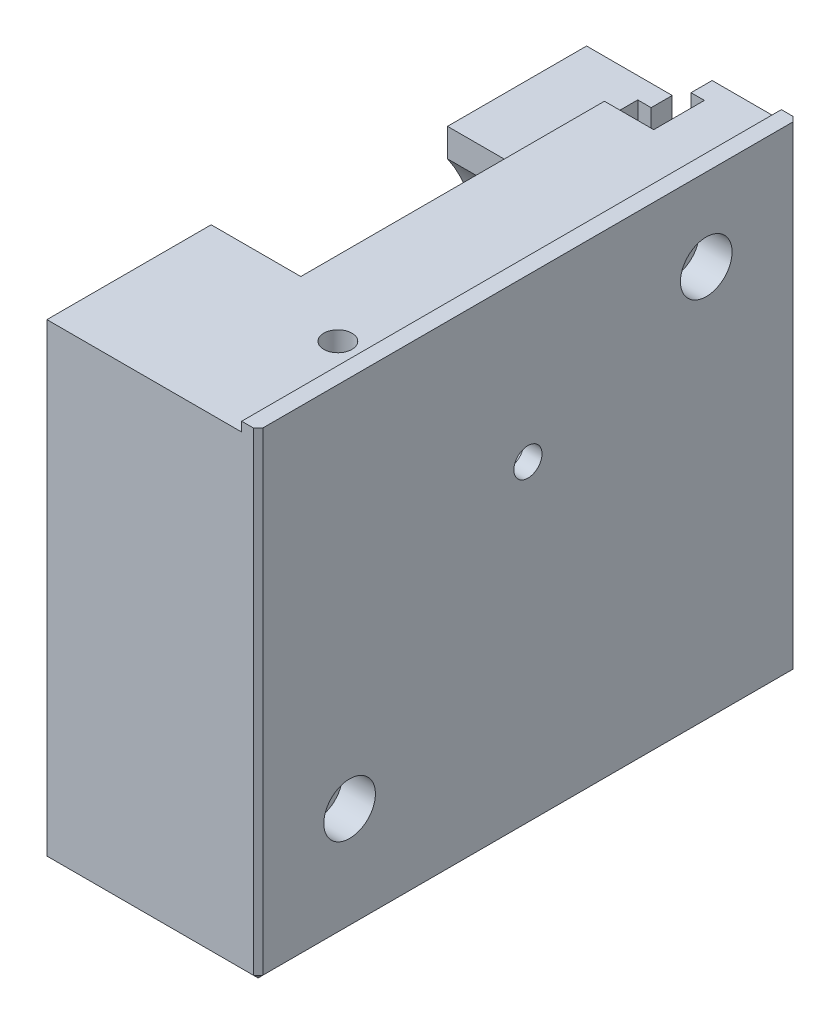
ISO-10303-21;
HEADER;
FILE_DESCRIPTION(('STEP AP214'),'2;1');
FILE_NAME('part.step','',(''),(''),'','','');
FILE_SCHEMA(('AUTOMOTIVE_DESIGN { 1 0 10303 214 1 1 1 1 }'));
ENDSEC;
DATA;
#1=APPLICATION_CONTEXT('core data for automotive mechanical design processes');
#2=APPLICATION_PROTOCOL_DEFINITION('international standard','automotive_design',2000,#1);
#3=PRODUCT_CONTEXT('',#1,'mechanical');
#4=PRODUCT('Part','Part','',(#3));
#5=PRODUCT_RELATED_PRODUCT_CATEGORY('part','',(#4));
#6=PRODUCT_DEFINITION_FORMATION('','',#4);
#7=PRODUCT_DEFINITION_CONTEXT('part definition',#1,'design');
#8=PRODUCT_DEFINITION('design','',#6,#7);
#9=PRODUCT_DEFINITION_SHAPE('','',#8);
#10=(LENGTH_UNIT() NAMED_UNIT(*) SI_UNIT(.MILLI.,.METRE.));
#11=(NAMED_UNIT(*) PLANE_ANGLE_UNIT() SI_UNIT($,.RADIAN.));
#12=(NAMED_UNIT(*) SI_UNIT($,.STERADIAN.) SOLID_ANGLE_UNIT());
#13=UNCERTAINTY_MEASURE_WITH_UNIT(LENGTH_MEASURE(1.E-05),#10,'distance_accuracy_value','');
#14=(GEOMETRIC_REPRESENTATION_CONTEXT(3) GLOBAL_UNCERTAINTY_ASSIGNED_CONTEXT((#13)) GLOBAL_UNIT_ASSIGNED_CONTEXT((#10,
#11,#12)) REPRESENTATION_CONTEXT('',''));
#15=CARTESIAN_POINT('',(0.,0.,0.));
#16=DIRECTION('',(0.,0.,1.));
#17=DIRECTION('',(1.,0.,0.));
#18=AXIS2_PLACEMENT_3D('',#15,#16,#17);
#19=CARTESIAN_POINT('',(35.,84.0000000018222,88.));
#20=DIRECTION('',(0.,1.,0.));
#21=DIRECTION('',(0.,0.,1.));
#22=AXIS2_PLACEMENT_3D('',#19,#20,#21);
#23=CONICAL_SURFACE('',#22,2.99999999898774,1.02974425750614);
#24=CARTESIAN_POINT('',(35.0000000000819,82.1974181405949,88.));
#25=VERTEX_POINT('',#24);
#26=VERTEX_LOOP('',#25);
#27=FACE_BOUND('',#26,.T.);
#28=CARTESIAN_POINT('',(35.,84.,88.));
#29=DIRECTION('',(0.,-1.,0.));
#30=DIRECTION('',(1.,0.,0.));
#31=AXIS2_PLACEMENT_3D('',#28,#29,#30);
#32=CIRCLE('',#31,3.);
#33=CARTESIAN_POINT('',(38.,84.,88.));
#34=VERTEX_POINT('',#33);
#35=EDGE_CURVE('E299',#34,#34,#32,.F.);
#36=ORIENTED_EDGE('',*,*,#35,.T.);
#37=EDGE_LOOP('',(#36));
#38=FACE_BOUND('',#37,.T.);
#39=ADVANCED_FACE('F16',(#27,#38),#23,.F.);
#40=CARTESIAN_POINT('',(15.4,92.9901941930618,4.5));
#41=DIRECTION('',(0.,0.,-1.));
#42=DIRECTION('',(1.,0.,0.));
#43=AXIS2_PLACEMENT_3D('',#40,#41,#42);
#44=PLANE('',#43);
#45=DIRECTION('',(0.,1.,0.));
#46=VECTOR('',#45,1.);
#47=CARTESIAN_POINT('',(18.25,76.2401941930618,4.5));
#48=LINE('',#47,#46);
#49=CARTESIAN_POINT('',(18.25,59.4901941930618,4.5));
#50=VERTEX_POINT('',#49);
#51=CARTESIAN_POINT('',(18.25,92.9901941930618,4.5));
#52=VERTEX_POINT('',#51);
#53=EDGE_CURVE('E286',#50,#52,#48,.T.);
#54=ORIENTED_EDGE('',*,*,#53,.T.);
#55=DIRECTION('',(-1.,0.,0.));
#56=VECTOR('',#55,1.);
#57=CARTESIAN_POINT('',(9.54999999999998,92.9901941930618,4.5));
#58=LINE('',#57,#56);
#59=CARTESIAN_POINT('',(15.4,92.9901941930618,4.5));
#60=VERTEX_POINT('',#59);
#61=EDGE_CURVE('E375',#52,#60,#58,.T.);
#62=ORIENTED_EDGE('',*,*,#61,.T.);
#63=DIRECTION('',(0.,-1.,0.));
#64=VECTOR('',#63,1.);
#65=CARTESIAN_POINT('',(15.4,76.2401941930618,4.5));
#66=LINE('',#65,#64);
#67=CARTESIAN_POINT('',(15.4,59.4901941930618,4.5));
#68=VERTEX_POINT('',#67);
#69=EDGE_CURVE('E369',#60,#68,#66,.T.);
#70=ORIENTED_EDGE('',*,*,#69,.T.);
#71=DIRECTION('',(1.,0.,0.));
#72=VECTOR('',#71,1.);
#73=CARTESIAN_POINT('',(9.54999999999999,59.4901941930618,4.5));
#74=LINE('',#73,#72);
#75=EDGE_CURVE('E363',#68,#50,#74,.T.);
#76=ORIENTED_EDGE('',*,*,#75,.T.);
#77=EDGE_LOOP('',(#54,#62,#70,#76));
#78=FACE_BOUND('',#77,.T.);
#79=ADVANCED_FACE('F1211',(#78),#44,.F.);
#80=CARTESIAN_POINT('',(18.25,92.9901941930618,4.5));
#81=DIRECTION('',(-1.,0.,0.));
#82=DIRECTION('',(0.,0.,-1.));
#83=AXIS2_PLACEMENT_3D('',#80,#81,#82);
#84=PLANE('',#83);
#85=DIRECTION('',(0.,1.,0.));
#86=VECTOR('',#85,1.);
#87=CARTESIAN_POINT('',(18.25,76.2401941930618,0.));
#88=LINE('',#87,#86);
#89=CARTESIAN_POINT('',(18.25,59.4901941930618,0.));
#90=VERTEX_POINT('',#89);
#91=CARTESIAN_POINT('',(18.25,92.9901941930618,0.));
#92=VERTEX_POINT('',#91);
#93=EDGE_CURVE('E285',#90,#92,#88,.T.);
#94=ORIENTED_EDGE('',*,*,#93,.T.);
#95=DIRECTION('',(0.,0.,1.));
#96=VECTOR('',#95,1.);
#97=CARTESIAN_POINT('',(18.25,92.9901941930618,14.8204241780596));
#98=LINE('',#97,#96);
#99=EDGE_CURVE('E377',#92,#52,#98,.T.);
#100=ORIENTED_EDGE('',*,*,#99,.T.);
#101=ORIENTED_EDGE('',*,*,#53,.F.);
#102=DIRECTION('',(0.,0.,-1.));
#103=VECTOR('',#102,1.);
#104=CARTESIAN_POINT('',(18.25,59.4901941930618,12.2284760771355));
#105=LINE('',#104,#103);
#106=EDGE_CURVE('E336',#50,#90,#105,.T.);
#107=ORIENTED_EDGE('',*,*,#106,.T.);
#108=EDGE_LOOP('',(#94,#100,#101,#107));
#109=FACE_BOUND('',#108,.T.);
#110=ADVANCED_FACE('F1203',(#109),#84,.F.);
#111=CARTESIAN_POINT('',(23.9999999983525,22.5,19.5));
#112=DIRECTION('',(-1.,0.,0.));
#113=DIRECTION('',(0.,0.,1.));
#114=AXIS2_PLACEMENT_3D('',#111,#112,#113);
#115=CONICAL_SURFACE('',#114,2.99999999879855,1.02974425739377);
#116=CARTESIAN_POINT('',(25.8025818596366,22.5,19.5000000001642));
#117=VERTEX_POINT('',#116);
#118=VERTEX_LOOP('',#117);
#119=FACE_BOUND('',#118,.T.);
#120=CARTESIAN_POINT('',(24.,22.5,19.5));
#121=DIRECTION('',(1.,0.,0.));
#122=DIRECTION('',(0.,1.,0.));
#123=AXIS2_PLACEMENT_3D('',#120,#121,#122);
#124=CIRCLE('',#123,3.);
#125=CARTESIAN_POINT('',(24.,25.5,19.5));
#126=VERTEX_POINT('',#125);
#127=EDGE_CURVE('E347',#126,#126,#124,.F.);
#128=ORIENTED_EDGE('',*,*,#127,.T.);
#129=EDGE_LOOP('',(#128));
#130=FACE_BOUND('',#129,.T.);
#131=ADVANCED_FACE('F1195',(#119,#130),#115,.F.);
#132=CARTESIAN_POINT('',(23.9999999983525,84.5,95.5));
#133=DIRECTION('',(-1.,0.,0.));
#134=DIRECTION('',(0.,0.,1.));
#135=AXIS2_PLACEMENT_3D('',#132,#133,#134);
#136=CONICAL_SURFACE('',#135,2.99999999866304,1.02974425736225);
#137=CARTESIAN_POINT('',(25.8025818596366,84.5,95.5000000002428));
#138=VERTEX_POINT('',#137);
#139=VERTEX_LOOP('',#138);
#140=FACE_BOUND('',#139,.T.);
#141=CARTESIAN_POINT('',(24.,84.5,95.5));
#142=DIRECTION('',(1.,0.,0.));
#143=DIRECTION('',(0.,1.,0.));
#144=AXIS2_PLACEMENT_3D('',#141,#142,#143);
#145=CIRCLE('',#144,3.);
#146=CARTESIAN_POINT('',(24.,87.5,95.5));
#147=VERTEX_POINT('',#146);
#148=EDGE_CURVE('E676',#147,#147,#145,.F.);
#149=ORIENTED_EDGE('',*,*,#148,.T.);
#150=EDGE_LOOP('',(#149));
#151=FACE_BOUND('',#150,.T.);
#152=ADVANCED_FACE('F1188',(#140,#151),#136,.F.);
#153=CARTESIAN_POINT('',(0.,67.5,57.5));
#154=DIRECTION('',(1.,0.,0.));
#155=DIRECTION('',(0.,1.,0.));
#156=AXIS2_PLACEMENT_3D('',#153,#154,#155);
#157=CYLINDRICAL_SURFACE('',#156,34.);
#158=DIRECTION('',(-1.,0.,0.));
#159=VECTOR('',#158,1.);
#160=CARTESIAN_POINT('',(9.54999999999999,86.9901941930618,29.6408483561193));
#161=LINE('',#160,#159);
#162=CARTESIAN_POINT('',(19.1,86.9901941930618,29.6408483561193));
#163=VERTEX_POINT('',#162);
#164=CARTESIAN_POINT('',(0.,86.9901941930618,29.6408483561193));
#165=VERTEX_POINT('',#164);
#166=EDGE_CURVE('E274',#163,#165,#161,.T.);
#167=ORIENTED_EDGE('',*,*,#166,.T.);
#168=CARTESIAN_POINT('',(0.,67.5,57.5));
#169=DIRECTION('',(1.,0.,0.));
#170=DIRECTION('',(0.,1.,0.));
#171=AXIS2_PLACEMENT_3D('',#168,#169,#170);
#172=CIRCLE('',#171,34.);
#173=CARTESIAN_POINT('',(0.,59.4901941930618,24.4569521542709));
#174=VERTEX_POINT('',#173);
#175=EDGE_CURVE('E520',#174,#165,#172,.T.);
#176=ORIENTED_EDGE('',*,*,#175,.F.);
#177=DIRECTION('',(1.,0.,0.));
#178=VECTOR('',#177,1.);
#179=CARTESIAN_POINT('',(9.54999999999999,59.4901941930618,24.456952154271));
#180=LINE('',#179,#178);
#181=CARTESIAN_POINT('',(19.1,59.4901941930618,24.4569521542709));
#182=VERTEX_POINT('',#181);
#183=EDGE_CURVE('E291',#174,#182,#180,.T.);
#184=ORIENTED_EDGE('',*,*,#183,.T.);
#185=CARTESIAN_POINT('',(19.1,67.5,57.5));
#186=DIRECTION('',(1.,0.,0.));
#187=DIRECTION('',(0.,1.,0.));
#188=AXIS2_PLACEMENT_3D('',#185,#186,#187);
#189=CIRCLE('',#188,34.);
#190=EDGE_CURVE('E20',#163,#182,#189,.F.);
#191=ORIENTED_EDGE('',*,*,#190,.F.);
#192=EDGE_LOOP('',(#167,#176,#184,#191));
#193=FACE_BOUND('',#192,.T.);
#194=ADVANCED_FACE('F290',(#193),#157,.F.);
#195=CARTESIAN_POINT('',(0.,92.9901941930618,29.6408483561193));
#196=DIRECTION('',(0.,0.,-1.));
#197=DIRECTION('',(1.,0.,0.));
#198=AXIS2_PLACEMENT_3D('',#195,#196,#197);
#199=PLANE('',#198);
#200=DIRECTION('',(-1.,0.,0.));
#201=VECTOR('',#200,1.);
#202=CARTESIAN_POINT('',(9.54999999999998,92.9901941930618,29.6408483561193));
#203=LINE('',#202,#201);
#204=CARTESIAN_POINT('',(19.1,92.9901941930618,29.6408483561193));
#205=VERTEX_POINT('',#204);
#206=CARTESIAN_POINT('',(0.,92.9901941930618,29.6408483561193));
#207=VERTEX_POINT('',#206);
#208=EDGE_CURVE('E329',#205,#207,#203,.T.);
#209=ORIENTED_EDGE('',*,*,#208,.T.);
#210=DIRECTION('',(0.,1.,0.));
#211=VECTOR('',#210,1.);
#212=CARTESIAN_POINT('',(0.,76.2401941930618,29.6408483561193));
#213=LINE('',#212,#211);
#214=EDGE_CURVE('E281',#165,#207,#213,.T.);
#215=ORIENTED_EDGE('',*,*,#214,.F.);
#216=ORIENTED_EDGE('',*,*,#166,.F.);
#217=DIRECTION('',(0.,-1.,0.));
#218=VECTOR('',#217,1.);
#219=CARTESIAN_POINT('',(19.1,63.7075,29.6408483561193));
#220=LINE('',#219,#218);
#221=EDGE_CURVE('E278',#205,#163,#220,.T.);
#222=ORIENTED_EDGE('',*,*,#221,.F.);
#223=EDGE_LOOP('',(#209,#215,#216,#222));
#224=FACE_BOUND('',#223,.T.);
#225=ADVANCED_FACE('F276',(#224),#199,.F.);
#226=CARTESIAN_POINT('',(18.25,92.9901941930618,0.));
#227=DIRECTION('',(0.,0.,1.));
#228=DIRECTION('',(-1.,0.,0.));
#229=AXIS2_PLACEMENT_3D('',#226,#227,#228);
#230=PLANE('',#229);
#231=DIRECTION('',(-1.,0.,0.));
#232=VECTOR('',#231,1.);
#233=CARTESIAN_POINT('',(9.54999999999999,59.4901941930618,0.));
#234=LINE('',#233,#232);
#235=CARTESIAN_POINT('',(0.,59.4901941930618,0.));
#236=VERTEX_POINT('',#235);
#237=EDGE_CURVE('E334',#90,#236,#234,.T.);
#238=ORIENTED_EDGE('',*,*,#237,.T.);
#239=DIRECTION('',(0.,-1.,0.));
#240=VECTOR('',#239,1.);
#241=CARTESIAN_POINT('',(0.,76.2401941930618,0.));
#242=LINE('',#241,#240);
#243=CARTESIAN_POINT('',(0.,92.9901941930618,0.));
#244=VERTEX_POINT('',#243);
#245=EDGE_CURVE('E328',#244,#236,#242,.T.);
#246=ORIENTED_EDGE('',*,*,#245,.F.);
#247=DIRECTION('',(1.,0.,0.));
#248=VECTOR('',#247,1.);
#249=CARTESIAN_POINT('',(9.54999999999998,92.9901941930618,0.));
#250=LINE('',#249,#248);
#251=EDGE_CURVE('E331',#244,#92,#250,.T.);
#252=ORIENTED_EDGE('',*,*,#251,.T.);
#253=ORIENTED_EDGE('',*,*,#93,.F.);
#254=EDGE_LOOP('',(#238,#246,#252,#253));
#255=FACE_BOUND('',#254,.T.);
#256=ADVANCED_FACE('F537',(#255),#230,.F.);
#257=CARTESIAN_POINT('',(19.1,67.5,57.5));
#258=DIRECTION('',(1.,0.,0.));
#259=DIRECTION('',(0.,0.,-1.));
#260=AXIS2_PLACEMENT_3D('',#257,#258,#259);
#261=CYLINDRICAL_SURFACE('',#260,31.);
#262=CARTESIAN_POINT('',(36.4,67.5,57.5));
#263=DIRECTION('',(1.,0.,0.));
#264=DIRECTION('',(0.,0.,-1.));
#265=AXIS2_PLACEMENT_3D('',#262,#263,#264);
#266=CIRCLE('',#265,31.);
#267=CARTESIAN_POINT('',(36.4,67.5,26.5));
#268=VERTEX_POINT('',#267);
#269=EDGE_CURVE('E339',#268,#268,#266,.T.);
#270=ORIENTED_EDGE('',*,*,#269,.T.);
#271=EDGE_LOOP('',(#270));
#272=FACE_BOUND('',#271,.T.);
#273=CARTESIAN_POINT('',(19.1,67.5,57.5));
#274=DIRECTION('',(1.,0.,0.));
#275=DIRECTION('',(0.,0.,-1.));
#276=AXIS2_PLACEMENT_3D('',#273,#274,#275);
#277=CIRCLE('',#276,31.);
#278=CARTESIAN_POINT('',(19.1,67.5,26.5));
#279=VERTEX_POINT('',#278);
#280=EDGE_CURVE('E294',#279,#279,#277,.T.);
#281=ORIENTED_EDGE('',*,*,#280,.F.);
#282=EDGE_LOOP('',(#281));
#283=FACE_BOUND('',#282,.T.);
#284=ADVANCED_FACE('F534',(#272,#283),#261,.F.);
#285=CARTESIAN_POINT('',(35.,92.,88.));
#286=DIRECTION('',(0.,-1.,0.));
#287=DIRECTION('',(1.,0.,0.));
#288=AXIS2_PLACEMENT_3D('',#285,#286,#287);
#289=CYLINDRICAL_SURFACE('',#288,3.);
#290=ORIENTED_EDGE('',*,*,#35,.F.);
#291=EDGE_LOOP('',(#290));
#292=FACE_BOUND('',#291,.T.);
#293=CARTESIAN_POINT('',(35.,100.,88.));
#294=DIRECTION('',(0.,-1.,0.));
#295=DIRECTION('',(1.,0.,0.));
#296=AXIS2_PLACEMENT_3D('',#293,#294,#295);
#297=CIRCLE('',#296,3.);
#298=CARTESIAN_POINT('',(38.,100.,88.));
#299=VERTEX_POINT('',#298);
#300=EDGE_CURVE('E343',#299,#299,#297,.T.);
#301=ORIENTED_EDGE('',*,*,#300,.F.);
#302=EDGE_LOOP('',(#301));
#303=FACE_BOUND('',#302,.T.);
#304=ADVANCED_FACE('F536',(#292,#303),#289,.F.);
#305=CARTESIAN_POINT('',(19.1,100.,92.4269666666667));
#306=DIRECTION('',(-1.,0.,0.));
#307=DIRECTION('',(0.,0.,-1.));
#308=AXIS2_PLACEMENT_3D('',#305,#306,#307);
#309=PLANE('',#308);
#310=ORIENTED_EDGE('',*,*,#280,.T.);
#311=EDGE_LOOP('',(#310));
#312=FACE_BOUND('',#311,.T.);
#313=ORIENTED_EDGE('',*,*,#190,.T.);
#314=DIRECTION('',(0.,0.,-1.));
#315=VECTOR('',#314,1.);
#316=CARTESIAN_POINT('',(19.1,59.4901941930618,12.2284760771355));
#317=LINE('',#316,#315);
#318=CARTESIAN_POINT('',(19.1,59.4901941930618,15.3));
#319=VERTEX_POINT('',#318);
#320=EDGE_CURVE('E333',#182,#319,#317,.T.);
#321=ORIENTED_EDGE('',*,*,#320,.T.);
#322=DIRECTION('',(0.,-1.,0.));
#323=VECTOR('',#322,1.);
#324=CARTESIAN_POINT('',(19.1,50.,15.3));
#325=LINE('',#324,#323);
#326=CARTESIAN_POINT('',(19.1,27.415,15.3));
#327=VERTEX_POINT('',#326);
#328=EDGE_CURVE('E350',#319,#327,#325,.T.);
#329=ORIENTED_EDGE('',*,*,#328,.T.);
#330=DIRECTION('',(0.,0.481918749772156,0.876215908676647));
#331=VECTOR('',#330,1.);
#332=CARTESIAN_POINT('',(19.1,24.5,9.99999999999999));
#333=LINE('',#332,#331);
#334=CARTESIAN_POINT('',(19.1,30.,20.));
#335=VERTEX_POINT('',#334);
#336=EDGE_CURVE('E312',#327,#335,#333,.T.);
#337=ORIENTED_EDGE('',*,*,#336,.T.);
#338=DIRECTION('',(0.,0.,1.));
#339=VECTOR('',#338,1.);
#340=CARTESIAN_POINT('',(19.1,30.,38.75));
#341=LINE('',#340,#339);
#342=CARTESIAN_POINT('',(19.1,30.,57.5));
#343=VERTEX_POINT('',#342);
#344=EDGE_CURVE('E344',#335,#343,#341,.T.);
#345=ORIENTED_EDGE('',*,*,#344,.T.);
#346=CARTESIAN_POINT('',(19.1,64.1633333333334,57.5));
#347=DIRECTION('',(1.,0.,0.));
#348=DIRECTION('',(0.,1.,0.));
#349=AXIS2_PLACEMENT_3D('',#346,#347,#348);
#350=CIRCLE('',#349,34.1633333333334);
#351=CARTESIAN_POINT('',(19.1,67.5000000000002,91.5));
#352=VERTEX_POINT('',#351);
#353=EDGE_CURVE('E523',#343,#352,#350,.F.);
#354=ORIENTED_EDGE('',*,*,#353,.T.);
#355=CARTESIAN_POINT('',(19.1,67.5,57.5));
#356=DIRECTION('',(1.,0.,0.));
#357=DIRECTION('',(0.,1.,0.));
#358=AXIS2_PLACEMENT_3D('',#355,#356,#357);
#359=CIRCLE('',#358,34.);
#360=CARTESIAN_POINT('',(19.1,92.9901941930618,80.));
#361=VERTEX_POINT('',#360);
#362=EDGE_CURVE('E528',#352,#361,#359,.F.);
#363=ORIENTED_EDGE('',*,*,#362,.T.);
#364=DIRECTION('',(0.,1.,0.));
#365=VECTOR('',#364,1.);
#366=CARTESIAN_POINT('',(19.1,96.4950970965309,80.));
#367=LINE('',#366,#365);
#368=CARTESIAN_POINT('',(19.1,100.,80.));
#369=VERTEX_POINT('',#368);
#370=EDGE_CURVE('E309',#361,#369,#367,.T.);
#371=ORIENTED_EDGE('',*,*,#370,.T.);
#372=DIRECTION('',(0.,0.,1.));
#373=VECTOR('',#372,1.);
#374=CARTESIAN_POINT('',(19.1,100.,57.5));
#375=LINE('',#374,#373);
#376=CARTESIAN_POINT('',(19.1,100.,15.3));
#377=VERTEX_POINT('',#376);
#378=EDGE_CURVE('E313',#377,#369,#375,.T.);
#379=ORIENTED_EDGE('',*,*,#378,.F.);
#380=DIRECTION('',(0.,-1.,0.));
#381=VECTOR('',#380,1.);
#382=CARTESIAN_POINT('',(19.1,50.,15.3));
#383=LINE('',#382,#381);
#384=CARTESIAN_POINT('',(19.1,92.9901941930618,15.3));
#385=VERTEX_POINT('',#384);
#386=EDGE_CURVE('E321',#377,#385,#383,.T.);
#387=ORIENTED_EDGE('',*,*,#386,.T.);
#388=DIRECTION('',(0.,0.,1.));
#389=VECTOR('',#388,1.);
#390=CARTESIAN_POINT('',(19.1,92.9901941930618,14.8204241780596));
#391=LINE('',#390,#389);
#392=EDGE_CURVE('E297',#385,#205,#391,.T.);
#393=ORIENTED_EDGE('',*,*,#392,.T.);
#394=ORIENTED_EDGE('',*,*,#221,.T.);
#395=EDGE_LOOP('',(#313,#321,#329,#337,#345,#354,#363,#371,#379,#387,#393,#394));
#396=FACE_BOUND('',#395,.T.);
#397=ADVANCED_FACE('F295',(#312,#396),#309,.T.);
#398=CARTESIAN_POINT('',(0.,92.9901941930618,29.6408483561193));
#399=DIRECTION('',(0.,-1.,0.));
#400=DIRECTION('',(0.,0.,-1.));
#401=AXIS2_PLACEMENT_3D('',#398,#399,#400);
#402=PLANE('',#401);
#403=DIRECTION('',(0.,0.,-1.));
#404=VECTOR('',#403,1.);
#405=CARTESIAN_POINT('',(15.4,92.9901941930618,9.9));
#406=LINE('',#405,#404);
#407=CARTESIAN_POINT('',(15.4,92.9901941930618,15.3));
#408=VERTEX_POINT('',#407);
#409=EDGE_CURVE('E371',#408,#60,#406,.T.);
#410=ORIENTED_EDGE('',*,*,#409,.T.);
#411=ORIENTED_EDGE('',*,*,#61,.F.);
#412=ORIENTED_EDGE('',*,*,#99,.F.);
#413=ORIENTED_EDGE('',*,*,#251,.F.);
#414=DIRECTION('',(0.,0.,-1.));
#415=VECTOR('',#414,1.);
#416=CARTESIAN_POINT('',(0.,92.9901941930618,14.8204241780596));
#417=LINE('',#416,#415);
#418=EDGE_CURVE('E325',#207,#244,#417,.T.);
#419=ORIENTED_EDGE('',*,*,#418,.F.);
#420=ORIENTED_EDGE('',*,*,#208,.F.);
#421=ORIENTED_EDGE('',*,*,#392,.F.);
#422=DIRECTION('',(-1.,0.,0.));
#423=VECTOR('',#422,1.);
#424=CARTESIAN_POINT('',(22.5,92.9901941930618,15.3));
#425=LINE('',#424,#423);
#426=EDGE_CURVE('E323',#385,#408,#425,.T.);
#427=ORIENTED_EDGE('',*,*,#426,.T.);
#428=EDGE_LOOP('',(#410,#411,#412,#413,#419,#420,#421,#427));
#429=FACE_BOUND('',#428,.T.);
#430=ADVANCED_FACE('F1152',(#429),#402,.F.);
#431=CARTESIAN_POINT('',(15.4,92.9901941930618,15.3));
#432=DIRECTION('',(-1.,0.,0.));
#433=DIRECTION('',(0.,0.,-1.));
#434=AXIS2_PLACEMENT_3D('',#431,#432,#433);
#435=PLANE('',#434);
#436=ORIENTED_EDGE('',*,*,#69,.F.);
#437=ORIENTED_EDGE('',*,*,#409,.F.);
#438=DIRECTION('',(0.,-1.,0.));
#439=VECTOR('',#438,1.);
#440=CARTESIAN_POINT('',(15.4,50.,15.3));
#441=LINE('',#440,#439);
#442=CARTESIAN_POINT('',(15.4,59.4901941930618,15.3));
#443=VERTEX_POINT('',#442);
#444=EDGE_CURVE('E360',#408,#443,#441,.T.);
#445=ORIENTED_EDGE('',*,*,#444,.T.);
#446=DIRECTION('',(0.,0.,-1.));
#447=VECTOR('',#446,1.);
#448=CARTESIAN_POINT('',(15.4,59.4901941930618,12.2284760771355));
#449=LINE('',#448,#447);
#450=EDGE_CURVE('E366',#443,#68,#449,.T.);
#451=ORIENTED_EDGE('',*,*,#450,.T.);
#452=EDGE_LOOP('',(#436,#437,#445,#451));
#453=FACE_BOUND('',#452,.T.);
#454=ADVANCED_FACE('F1144',(#453),#435,.F.);
#455=CARTESIAN_POINT('',(0.,59.4901941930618,0.));
#456=DIRECTION('',(0.,1.,0.));
#457=DIRECTION('',(0.,0.,1.));
#458=AXIS2_PLACEMENT_3D('',#455,#456,#457);
#459=PLANE('',#458);
#460=ORIENTED_EDGE('',*,*,#320,.F.);
#461=ORIENTED_EDGE('',*,*,#183,.F.);
#462=DIRECTION('',(0.,0.,1.));
#463=VECTOR('',#462,1.);
#464=CARTESIAN_POINT('',(0.,59.4901941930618,14.8204241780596));
#465=LINE('',#464,#463);
#466=EDGE_CURVE('E522',#236,#174,#465,.T.);
#467=ORIENTED_EDGE('',*,*,#466,.F.);
#468=ORIENTED_EDGE('',*,*,#237,.F.);
#469=ORIENTED_EDGE('',*,*,#106,.F.);
#470=ORIENTED_EDGE('',*,*,#75,.F.);
#471=ORIENTED_EDGE('',*,*,#450,.F.);
#472=DIRECTION('',(1.,0.,0.));
#473=VECTOR('',#472,1.);
#474=CARTESIAN_POINT('',(22.5,59.4901941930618,15.3));
#475=LINE('',#474,#473);
#476=EDGE_CURVE('E356',#443,#319,#475,.T.);
#477=ORIENTED_EDGE('',*,*,#476,.T.);
#478=EDGE_LOOP('',(#460,#461,#467,#468,#469,#470,#471,#477));
#479=FACE_BOUND('',#478,.T.);
#480=ADVANCED_FACE('F1137',(#479),#459,.F.);
#481=CARTESIAN_POINT('',(29.75,59.4901941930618,4.5));
#482=DIRECTION('',(0.,0.,1.));
#483=DIRECTION('',(-1.,0.,0.));
#484=AXIS2_PLACEMENT_3D('',#481,#482,#483);
#485=PLANE('',#484);
#486=DIRECTION('',(1.,0.,0.));
#487=VECTOR('',#486,1.);
#488=CARTESIAN_POINT('',(28.25,59.4901941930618,4.5));
#489=LINE('',#488,#487);
#490=CARTESIAN_POINT('',(29.6,59.4901941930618,4.5));
#491=VERTEX_POINT('',#490);
#492=CARTESIAN_POINT('',(29.75,59.4901941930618,4.5));
#493=VERTEX_POINT('',#492);
#494=EDGE_CURVE('E665',#491,#493,#489,.T.);
#495=ORIENTED_EDGE('',*,*,#494,.T.);
#496=DIRECTION('',(0.,1.,0.));
#497=VECTOR('',#496,1.);
#498=CARTESIAN_POINT('',(29.75,39.2450970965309,4.5));
#499=LINE('',#498,#497);
#500=CARTESIAN_POINT('',(29.75,21.475,4.5));
#501=VERTEX_POINT('',#500);
#502=EDGE_CURVE('E662',#501,#493,#499,.T.);
#503=ORIENTED_EDGE('',*,*,#502,.F.);
#504=DIRECTION('',(-1.,0.,0.));
#505=VECTOR('',#504,1.);
#506=CARTESIAN_POINT('',(28.25,21.475,4.5));
#507=LINE('',#506,#505);
#508=CARTESIAN_POINT('',(29.6,21.475,4.5));
#509=VERTEX_POINT('',#508);
#510=EDGE_CURVE('E657',#501,#509,#507,.T.);
#511=ORIENTED_EDGE('',*,*,#510,.T.);
#512=DIRECTION('',(0.,1.,0.));
#513=VECTOR('',#512,1.);
#514=CARTESIAN_POINT('',(29.6,50.,4.5));
#515=LINE('',#514,#513);
#516=EDGE_CURVE('E646',#509,#491,#515,.T.);
#517=ORIENTED_EDGE('',*,*,#516,.T.);
#518=EDGE_LOOP('',(#495,#503,#511,#517));
#519=FACE_BOUND('',#518,.T.);
#520=ADVANCED_FACE('F847',(#519),#485,.F.);
#521=CARTESIAN_POINT('',(26.75,100.,4.5));
#522=DIRECTION('',(0.,0.,-1.));
#523=DIRECTION('',(1.,0.,0.));
#524=AXIS2_PLACEMENT_3D('',#521,#522,#523);
#525=PLANE('',#524);
#526=DIRECTION('',(0.,1.,0.));
#527=VECTOR('',#526,1.);
#528=CARTESIAN_POINT('',(29.6,50.,4.5));
#529=LINE('',#528,#527);
#530=CARTESIAN_POINT('',(29.6,100.,4.5));
#531=VERTEX_POINT('',#530);
#532=EDGE_CURVE('E644',#491,#531,#529,.T.);
#533=ORIENTED_EDGE('',*,*,#532,.T.);
#534=DIRECTION('',(1.,0.,0.));
#535=VECTOR('',#534,1.);
#536=CARTESIAN_POINT('',(20.75,100.,4.5));
#537=LINE('',#536,#535);
#538=CARTESIAN_POINT('',(26.75,100.,4.5));
#539=VERTEX_POINT('',#538);
#540=EDGE_CURVE('E516',#539,#531,#537,.T.);
#541=ORIENTED_EDGE('',*,*,#540,.F.);
#542=DIRECTION('',(0.,-1.,0.));
#543=VECTOR('',#542,1.);
#544=CARTESIAN_POINT('',(26.75,79.7450970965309,4.5));
#545=LINE('',#544,#543);
#546=CARTESIAN_POINT('',(26.75,59.4901941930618,4.5));
#547=VERTEX_POINT('',#546);
#548=EDGE_CURVE('E519',#539,#547,#545,.T.);
#549=ORIENTED_EDGE('',*,*,#548,.T.);
#550=DIRECTION('',(1.,0.,0.));
#551=VECTOR('',#550,1.);
#552=CARTESIAN_POINT('',(28.25,59.4901941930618,4.5));
#553=LINE('',#552,#551);
#554=EDGE_CURVE('E667',#547,#491,#553,.T.);
#555=ORIENTED_EDGE('',*,*,#554,.T.);
#556=EDGE_LOOP('',(#533,#541,#549,#555));
#557=FACE_BOUND('',#556,.T.);
#558=ADVANCED_FACE('F844',(#557),#525,.F.);
#559=CARTESIAN_POINT('',(0.,30.,20.));
#560=DIRECTION('',(0.,-0.876215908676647,0.481918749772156));
#561=DIRECTION('',(0.,-0.481918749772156,-0.876215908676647));
#562=AXIS2_PLACEMENT_3D('',#559,#560,#561);
#563=PLANE('',#562);
#564=DIRECTION('',(0.,-0.481918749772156,-0.876215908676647));
#565=VECTOR('',#564,1.);
#566=CARTESIAN_POINT('',(15.4,30.,20.));
#567=LINE('',#566,#565);
#568=CARTESIAN_POINT('',(15.4,27.415,15.3));
#569=VERTEX_POINT('',#568);
#570=CARTESIAN_POINT('',(15.4,21.475,4.5));
#571=VERTEX_POINT('',#570);
#572=EDGE_CURVE('E353',#569,#571,#567,.T.);
#573=ORIENTED_EDGE('',*,*,#572,.T.);
#574=DIRECTION('',(1.,0.,0.));
#575=VECTOR('',#574,1.);
#576=CARTESIAN_POINT('',(16.825,21.475,4.5));
#577=LINE('',#576,#575);
#578=CARTESIAN_POINT('',(18.25,21.475,4.5));
#579=VERTEX_POINT('',#578);
#580=EDGE_CURVE('E384',#571,#579,#577,.T.);
#581=ORIENTED_EDGE('',*,*,#580,.T.);
#582=DIRECTION('',(0.,-0.481918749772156,-0.876215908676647));
#583=VECTOR('',#582,1.);
#584=CARTESIAN_POINT('',(18.25,30.,20.));
#585=LINE('',#584,#583);
#586=CARTESIAN_POINT('',(18.25,19.,0.));
#587=VERTEX_POINT('',#586);
#588=EDGE_CURVE('E342',#579,#587,#585,.T.);
#589=ORIENTED_EDGE('',*,*,#588,.T.);
#590=DIRECTION('',(-1.,0.,0.));
#591=VECTOR('',#590,1.);
#592=CARTESIAN_POINT('',(9.125,19.,0.));
#593=LINE('',#592,#591);
#594=CARTESIAN_POINT('',(0.,19.,0.));
#595=VERTEX_POINT('',#594);
#596=EDGE_CURVE('E304',#587,#595,#593,.T.);
#597=ORIENTED_EDGE('',*,*,#596,.T.);
#598=DIRECTION('',(0.,-0.481918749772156,-0.876215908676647));
#599=VECTOR('',#598,1.);
#600=CARTESIAN_POINT('',(0.,30.,20.));
#601=LINE('',#600,#599);
#602=CARTESIAN_POINT('',(0.,30.,20.));
#603=VERTEX_POINT('',#602);
#604=EDGE_CURVE('E503',#603,#595,#601,.T.);
#605=ORIENTED_EDGE('',*,*,#604,.F.);
#606=DIRECTION('',(1.,0.,0.));
#607=VECTOR('',#606,1.);
#608=CARTESIAN_POINT('',(9.54999999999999,30.,20.));
#609=LINE('',#608,#607);
#610=EDGE_CURVE('E348',#603,#335,#609,.T.);
#611=ORIENTED_EDGE('',*,*,#610,.T.);
#612=ORIENTED_EDGE('',*,*,#336,.F.);
#613=DIRECTION('',(-1.,0.,0.));
#614=VECTOR('',#613,1.);
#615=CARTESIAN_POINT('',(22.5,27.415,15.3));
#616=LINE('',#615,#614);
#617=EDGE_CURVE('E352',#327,#569,#616,.T.);
#618=ORIENTED_EDGE('',*,*,#617,.T.);
#619=EDGE_LOOP('',(#573,#581,#589,#597,#605,#611,#612,#618));
#620=FACE_BOUND('',#619,.T.);
#621=ADVANCED_FACE('F743',(#620),#563,.F.);
#622=CARTESIAN_POINT('',(19.1,100.,80.));
#623=DIRECTION('',(0.,0.,1.));
#624=DIRECTION('',(-1.,0.,0.));
#625=AXIS2_PLACEMENT_3D('',#622,#623,#624);
#626=PLANE('',#625);
#627=DIRECTION('',(-1.,0.,0.));
#628=VECTOR('',#627,1.);
#629=CARTESIAN_POINT('',(9.54999999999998,92.9901941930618,80.));
#630=LINE('',#629,#628);
#631=CARTESIAN_POINT('',(0.,92.9901941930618,80.));
#632=VERTEX_POINT('',#631);
#633=EDGE_CURVE('E311',#361,#632,#630,.T.);
#634=ORIENTED_EDGE('',*,*,#633,.T.);
#635=DIRECTION('',(0.,-1.,0.));
#636=VECTOR('',#635,1.);
#637=CARTESIAN_POINT('',(0.,50.,80.));
#638=LINE('',#637,#636);
#639=CARTESIAN_POINT('',(0.,100.,80.));
#640=VERTEX_POINT('',#639);
#641=EDGE_CURVE('E498',#640,#632,#638,.T.);
#642=ORIENTED_EDGE('',*,*,#641,.F.);
#643=DIRECTION('',(-1.,0.,0.));
#644=VECTOR('',#643,1.);
#645=CARTESIAN_POINT('',(20.75,100.,80.));
#646=LINE('',#645,#644);
#647=EDGE_CURVE('E316',#369,#640,#646,.T.);
#648=ORIENTED_EDGE('',*,*,#647,.F.);
#649=ORIENTED_EDGE('',*,*,#370,.F.);
#650=EDGE_LOOP('',(#634,#642,#648,#649));
#651=FACE_BOUND('',#650,.T.);
#652=ADVANCED_FACE('F727',(#651),#626,.F.);
#653=CARTESIAN_POINT('',(0.,67.5,57.5));
#654=DIRECTION('',(1.,0.,0.));
#655=DIRECTION('',(0.,1.,0.));
#656=AXIS2_PLACEMENT_3D('',#653,#654,#655);
#657=CYLINDRICAL_SURFACE('',#656,34.);
#658=DIRECTION('',(-1.,0.,0.));
#659=VECTOR('',#658,1.);
#660=CARTESIAN_POINT('',(9.54999999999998,67.5000000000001,91.5));
#661=LINE('',#660,#659);
#662=CARTESIAN_POINT('',(0.,67.5000000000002,91.5));
#663=VERTEX_POINT('',#662);
#664=EDGE_CURVE('E527',#352,#663,#661,.T.);
#665=ORIENTED_EDGE('',*,*,#664,.T.);
#666=CARTESIAN_POINT('',(0.,67.5,57.5));
#667=DIRECTION('',(1.,0.,0.));
#668=DIRECTION('',(0.,1.,0.));
#669=AXIS2_PLACEMENT_3D('',#666,#667,#668);
#670=CIRCLE('',#669,34.);
#671=EDGE_CURVE('E495',#632,#663,#670,.T.);
#672=ORIENTED_EDGE('',*,*,#671,.F.);
#673=ORIENTED_EDGE('',*,*,#633,.F.);
#674=ORIENTED_EDGE('',*,*,#362,.F.);
#675=EDGE_LOOP('',(#665,#672,#673,#674));
#676=FACE_BOUND('',#675,.T.);
#677=ADVANCED_FACE('F730',(#676),#657,.F.);
#678=CARTESIAN_POINT('',(0.,64.1633333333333,57.5));
#679=DIRECTION('',(1.,0.,0.));
#680=DIRECTION('',(0.,1.,0.));
#681=AXIS2_PLACEMENT_3D('',#678,#679,#680);
#682=CYLINDRICAL_SURFACE('',#681,34.1633333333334);
#683=DIRECTION('',(-1.,0.,0.));
#684=VECTOR('',#683,1.);
#685=CARTESIAN_POINT('',(9.54999999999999,30.,57.5));
#686=LINE('',#685,#684);
#687=CARTESIAN_POINT('',(0.,30.,57.5));
#688=VERTEX_POINT('',#687);
#689=EDGE_CURVE('E526',#343,#688,#686,.T.);
#690=ORIENTED_EDGE('',*,*,#689,.T.);
#691=CARTESIAN_POINT('',(0.,64.1633333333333,57.5));
#692=DIRECTION('',(-1.,0.,0.));
#693=DIRECTION('',(0.,-1.,0.));
#694=AXIS2_PLACEMENT_3D('',#691,#692,#693);
#695=CIRCLE('',#694,34.1633333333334);
#696=EDGE_CURVE('E492',#663,#688,#695,.F.);
#697=ORIENTED_EDGE('',*,*,#696,.F.);
#698=ORIENTED_EDGE('',*,*,#664,.F.);
#699=ORIENTED_EDGE('',*,*,#353,.F.);
#700=EDGE_LOOP('',(#690,#697,#698,#699));
#701=FACE_BOUND('',#700,.T.);
#702=ADVANCED_FACE('F734',(#701),#682,.F.);
#703=CARTESIAN_POINT('',(0.,30.,57.5));
#704=DIRECTION('',(0.,-1.,0.));
#705=DIRECTION('',(0.,0.,-1.));
#706=AXIS2_PLACEMENT_3D('',#703,#704,#705);
#707=PLANE('',#706);
#708=ORIENTED_EDGE('',*,*,#610,.F.);
#709=DIRECTION('',(0.,0.,-1.));
#710=VECTOR('',#709,1.);
#711=CARTESIAN_POINT('',(0.,30.,57.5));
#712=LINE('',#711,#710);
#713=EDGE_CURVE('E491',#688,#603,#712,.T.);
#714=ORIENTED_EDGE('',*,*,#713,.F.);
#715=ORIENTED_EDGE('',*,*,#689,.F.);
#716=ORIENTED_EDGE('',*,*,#344,.F.);
#717=EDGE_LOOP('',(#708,#714,#715,#716));
#718=FACE_BOUND('',#717,.T.);
#719=ADVANCED_FACE('F739',(#718),#707,.F.);
#720=CARTESIAN_POINT('',(12.,22.5,19.5));
#721=DIRECTION('',(1.,0.,0.));
#722=DIRECTION('',(0.,1.,0.));
#723=AXIS2_PLACEMENT_3D('',#720,#721,#722);
#724=CYLINDRICAL_SURFACE('',#723,3.);
#725=ORIENTED_EDGE('',*,*,#127,.F.);
#726=EDGE_LOOP('',(#725));
#727=FACE_BOUND('',#726,.T.);
#728=CARTESIAN_POINT('',(0.,22.5,19.5));
#729=DIRECTION('',(1.,0.,0.));
#730=DIRECTION('',(0.,1.,0.));
#731=AXIS2_PLACEMENT_3D('',#728,#729,#730);
#732=CIRCLE('',#731,3.);
#733=CARTESIAN_POINT('',(0.,25.5,19.5));
#734=VERTEX_POINT('',#733);
#735=EDGE_CURVE('E488',#734,#734,#732,.T.);
#736=ORIENTED_EDGE('',*,*,#735,.F.);
#737=EDGE_LOOP('',(#736));
#738=FACE_BOUND('',#737,.T.);
#739=ADVANCED_FACE('F1086',(#727,#738),#724,.F.);
#740=CARTESIAN_POINT('',(12.,84.5,95.5));
#741=DIRECTION('',(1.,0.,0.));
#742=DIRECTION('',(0.,1.,0.));
#743=AXIS2_PLACEMENT_3D('',#740,#741,#742);
#744=CYLINDRICAL_SURFACE('',#743,3.);
#745=ORIENTED_EDGE('',*,*,#148,.F.);
#746=EDGE_LOOP('',(#745));
#747=FACE_BOUND('',#746,.T.);
#748=CARTESIAN_POINT('',(0.,84.5,95.5));
#749=DIRECTION('',(1.,0.,0.));
#750=DIRECTION('',(0.,1.,0.));
#751=AXIS2_PLACEMENT_3D('',#748,#749,#750);
#752=CIRCLE('',#751,3.);
#753=CARTESIAN_POINT('',(0.,87.5,95.5));
#754=VERTEX_POINT('',#753);
#755=EDGE_CURVE('E484',#754,#754,#752,.T.);
#756=ORIENTED_EDGE('',*,*,#755,.F.);
#757=EDGE_LOOP('',(#756));
#758=FACE_BOUND('',#757,.T.);
#759=ADVANCED_FACE('F1079',(#747,#758),#744,.F.);
#760=CARTESIAN_POINT('',(18.25,19.,0.));
#761=DIRECTION('',(0.,0.,1.));
#762=DIRECTION('',(-1.,0.,0.));
#763=AXIS2_PLACEMENT_3D('',#760,#761,#762);
#764=PLANE('',#763);
#765=DIRECTION('',(1.,0.,0.));
#766=VECTOR('',#765,1.);
#767=CARTESIAN_POINT('',(9.125,1.,0.));
#768=LINE('',#767,#766);
#769=CARTESIAN_POINT('',(0.,0.999999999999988,0.));
#770=VERTEX_POINT('',#769);
#771=CARTESIAN_POINT('',(18.25,0.999999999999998,0.));
#772=VERTEX_POINT('',#771);
#773=EDGE_CURVE('E483',#770,#772,#768,.T.);
#774=ORIENTED_EDGE('',*,*,#773,.F.);
#775=DIRECTION('',(0.,-1.,0.));
#776=VECTOR('',#775,1.);
#777=CARTESIAN_POINT('',(0.,50.,0.));
#778=LINE('',#777,#776);
#779=EDGE_CURVE('E502',#595,#770,#778,.T.);
#780=ORIENTED_EDGE('',*,*,#779,.F.);
#781=ORIENTED_EDGE('',*,*,#596,.F.);
#782=DIRECTION('',(0.,-1.,0.));
#783=VECTOR('',#782,1.);
#784=CARTESIAN_POINT('',(18.25,10.7375,0.));
#785=LINE('',#784,#783);
#786=EDGE_CURVE('E340',#587,#772,#785,.T.);
#787=ORIENTED_EDGE('',*,*,#786,.T.);
#788=EDGE_LOOP('',(#774,#780,#781,#787));
#789=FACE_BOUND('',#788,.T.);
#790=ADVANCED_FACE('F703',(#789),#764,.F.);
#791=CARTESIAN_POINT('',(0.,92.9901941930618,29.6408483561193));
#792=DIRECTION('',(-1.,0.,0.));
#793=DIRECTION('',(0.,0.,-1.));
#794=AXIS2_PLACEMENT_3D('',#791,#792,#793);
#795=PLANE('',#794);
#796=CARTESIAN_POINT('',(0.,84.5,19.5));
#797=DIRECTION('',(1.,0.,0.));
#798=DIRECTION('',(0.,1.,0.));
#799=AXIS2_PLACEMENT_3D('',#796,#797,#798);
#800=CIRCLE('',#799,3.3);
#801=CARTESIAN_POINT('',(0.,87.8,19.5));
#802=VERTEX_POINT('',#801);
#803=EDGE_CURVE('E480',#802,#802,#800,.T.);
#804=ORIENTED_EDGE('',*,*,#803,.T.);
#805=EDGE_LOOP('',(#804));
#806=FACE_BOUND('',#805,.T.);
#807=ORIENTED_EDGE('',*,*,#418,.T.);
#808=ORIENTED_EDGE('',*,*,#245,.T.);
#809=ORIENTED_EDGE('',*,*,#466,.T.);
#810=ORIENTED_EDGE('',*,*,#175,.T.);
#811=ORIENTED_EDGE('',*,*,#214,.T.);
#812=EDGE_LOOP('',(#807,#808,#809,#810,#811));
#813=FACE_BOUND('',#812,.T.);
#814=ADVANCED_FACE('F1064',(#806,#813),#795,.T.);
#815=CARTESIAN_POINT('',(36.4,99.12,25.88));
#816=DIRECTION('',(1.,0.,0.));
#817=DIRECTION('',(0.,0.,1.));
#818=AXIS2_PLACEMENT_3D('',#815,#816,#817);
#819=PLANE('',#818);
#820=CARTESIAN_POINT('',(36.4,67.5,57.5));
#821=DIRECTION('',(1.,0.,0.));
#822=DIRECTION('',(0.,0.,-1.));
#823=AXIS2_PLACEMENT_3D('',#820,#821,#822);
#824=CIRCLE('',#823,28.);
#825=CARTESIAN_POINT('',(36.4,67.5,29.5));
#826=VERTEX_POINT('',#825);
#827=EDGE_CURVE('E400',#826,#826,#824,.T.);
#828=ORIENTED_EDGE('',*,*,#827,.T.);
#829=EDGE_LOOP('',(#828));
#830=FACE_BOUND('',#829,.T.);
#831=ORIENTED_EDGE('',*,*,#269,.F.);
#832=EDGE_LOOP('',(#831));
#833=FACE_BOUND('',#832,.T.);
#834=ADVANCED_FACE('F1057',(#830,#833),#819,.F.);
#835=CARTESIAN_POINT('',(26.75,100.,0.));
#836=DIRECTION('',(1.,0.,0.));
#837=DIRECTION('',(0.,0.,1.));
#838=AXIS2_PLACEMENT_3D('',#835,#836,#837);
#839=PLANE('',#838);
#840=ORIENTED_EDGE('',*,*,#548,.F.);
#841=DIRECTION('',(0.,0.,1.));
#842=VECTOR('',#841,1.);
#843=CARTESIAN_POINT('',(26.75,100.,57.5));
#844=LINE('',#843,#842);
#845=CARTESIAN_POINT('',(26.75,100.,0.));
#846=VERTEX_POINT('',#845);
#847=EDGE_CURVE('E652',#846,#539,#844,.T.);
#848=ORIENTED_EDGE('',*,*,#847,.F.);
#849=DIRECTION('',(0.,-1.,0.));
#850=VECTOR('',#849,1.);
#851=CARTESIAN_POINT('',(26.75,51.5,0.));
#852=LINE('',#851,#850);
#853=CARTESIAN_POINT('',(26.75,59.4901941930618,0.));
#854=VERTEX_POINT('',#853);
#855=EDGE_CURVE('E619',#846,#854,#852,.T.);
#856=ORIENTED_EDGE('',*,*,#855,.T.);
#857=DIRECTION('',(0.,0.,1.));
#858=VECTOR('',#857,1.);
#859=CARTESIAN_POINT('',(26.75,59.4901941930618,2.25));
#860=LINE('',#859,#858);
#861=EDGE_CURVE('E669',#854,#547,#860,.T.);
#862=ORIENTED_EDGE('',*,*,#861,.T.);
#863=EDGE_LOOP('',(#840,#848,#856,#862));
#864=FACE_BOUND('',#863,.T.);
#865=ADVANCED_FACE('F840',(#864),#839,.F.);
#866=CARTESIAN_POINT('',(26.75,59.4901941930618,0.));
#867=DIRECTION('',(0.,1.,0.));
#868=DIRECTION('',(0.,0.,1.));
#869=AXIS2_PLACEMENT_3D('',#866,#867,#868);
#870=PLANE('',#869);
#871=ORIENTED_EDGE('',*,*,#494,.F.);
#872=ORIENTED_EDGE('',*,*,#554,.F.);
#873=ORIENTED_EDGE('',*,*,#861,.F.);
#874=DIRECTION('',(1.,0.,0.));
#875=VECTOR('',#874,1.);
#876=CARTESIAN_POINT('',(35.375,59.4901941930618,0.));
#877=LINE('',#876,#875);
#878=CARTESIAN_POINT('',(29.75,59.4901941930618,0.));
#879=VERTEX_POINT('',#878);
#880=EDGE_CURVE('E617',#854,#879,#877,.T.);
#881=ORIENTED_EDGE('',*,*,#880,.T.);
#882=DIRECTION('',(0.,0.,-1.));
#883=VECTOR('',#882,1.);
#884=CARTESIAN_POINT('',(29.75,59.4901941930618,2.25));
#885=LINE('',#884,#883);
#886=EDGE_CURVE('E659',#493,#879,#885,.T.);
#887=ORIENTED_EDGE('',*,*,#886,.F.);
#888=EDGE_LOOP('',(#871,#872,#873,#881,#887));
#889=FACE_BOUND('',#888,.T.);
#890=ADVANCED_FACE('F851',(#889),#870,.F.);
#891=CARTESIAN_POINT('',(29.75,59.4901941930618,4.5));
#892=DIRECTION('',(-1.,0.,0.));
#893=DIRECTION('',(0.,0.,-1.));
#894=AXIS2_PLACEMENT_3D('',#891,#892,#893);
#895=PLANE('',#894);
#896=ORIENTED_EDGE('',*,*,#886,.T.);
#897=DIRECTION('',(0.,-1.,0.));
#898=VECTOR('',#897,1.);
#899=CARTESIAN_POINT('',(29.75,51.5,0.));
#900=LINE('',#899,#898);
#901=CARTESIAN_POINT('',(29.75,19.,0.));
#902=VERTEX_POINT('',#901);
#903=EDGE_CURVE('E396',#879,#902,#900,.T.);
#904=ORIENTED_EDGE('',*,*,#903,.T.);
#905=DIRECTION('',(0.,0.481918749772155,0.876215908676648));
#906=VECTOR('',#905,1.);
#907=CARTESIAN_POINT('',(29.75,20.2375,2.25));
#908=LINE('',#907,#906);
#909=EDGE_CURVE('E317',#902,#501,#908,.T.);
#910=ORIENTED_EDGE('',*,*,#909,.T.);
#911=ORIENTED_EDGE('',*,*,#502,.T.);
#912=EDGE_LOOP('',(#896,#904,#910,#911));
#913=FACE_BOUND('',#912,.T.);
#914=ADVANCED_FACE('F853',(#913),#895,.T.);
#915=CARTESIAN_POINT('',(26.75,21.475,4.5));
#916=DIRECTION('',(0.,-0.876215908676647,0.481918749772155));
#917=DIRECTION('',(0.,-0.481918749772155,-0.876215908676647));
#918=AXIS2_PLACEMENT_3D('',#915,#916,#917);
#919=PLANE('',#918);
#920=DIRECTION('',(-1.,0.,0.));
#921=VECTOR('',#920,1.);
#922=CARTESIAN_POINT('',(35.375,19.,0.));
#923=LINE('',#922,#921);
#924=CARTESIAN_POINT('',(26.75,19.,0.));
#925=VERTEX_POINT('',#924);
#926=EDGE_CURVE('E392',#902,#925,#923,.T.);
#927=ORIENTED_EDGE('',*,*,#926,.T.);
#928=DIRECTION('',(0.,-0.481918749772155,-0.876215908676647));
#929=VECTOR('',#928,1.);
#930=CARTESIAN_POINT('',(26.75,21.475,4.5));
#931=LINE('',#930,#929);
#932=CARTESIAN_POINT('',(26.75,21.475,4.5));
#933=VERTEX_POINT('',#932);
#934=EDGE_CURVE('E407',#925,#933,#931,.F.);
#935=ORIENTED_EDGE('',*,*,#934,.T.);
#936=DIRECTION('',(1.,0.,0.));
#937=VECTOR('',#936,1.);
#938=CARTESIAN_POINT('',(28.175,21.475,4.5));
#939=LINE('',#938,#937);
#940=EDGE_CURVE('E401',#933,#509,#939,.T.);
#941=ORIENTED_EDGE('',*,*,#940,.T.);
#942=ORIENTED_EDGE('',*,*,#510,.F.);
#943=ORIENTED_EDGE('',*,*,#909,.F.);
#944=EDGE_LOOP('',(#927,#935,#941,#942,#943));
#945=FACE_BOUND('',#944,.T.);
#946=ADVANCED_FACE('F857',(#945),#919,.F.);
#947=CARTESIAN_POINT('',(0.,100.,0.));
#948=DIRECTION('',(0.,1.,0.));
#949=DIRECTION('',(0.,0.,1.));
#950=AXIS2_PLACEMENT_3D('',#947,#948,#949);
#951=PLANE('',#950);
#952=ORIENTED_EDGE('',*,*,#300,.T.);
#953=EDGE_LOOP('',(#952));
#954=FACE_BOUND('',#953,.T.);
#955=ORIENTED_EDGE('',*,*,#540,.T.);
#956=DIRECTION('',(0.,0.,1.));
#957=VECTOR('',#956,1.);
#958=CARTESIAN_POINT('',(29.6,100.,9.9));
#959=LINE('',#958,#957);
#960=CARTESIAN_POINT('',(29.6,100.,15.3));
#961=VERTEX_POINT('',#960);
#962=EDGE_CURVE('E641',#531,#961,#959,.T.);
#963=ORIENTED_EDGE('',*,*,#962,.T.);
#964=DIRECTION('',(-1.,0.,0.));
#965=VECTOR('',#964,1.);
#966=CARTESIAN_POINT('',(22.5,100.,15.3));
#967=LINE('',#966,#965);
#968=EDGE_CURVE('E318',#961,#377,#967,.T.);
#969=ORIENTED_EDGE('',*,*,#968,.T.);
#970=ORIENTED_EDGE('',*,*,#378,.T.);
#971=ORIENTED_EDGE('',*,*,#647,.T.);
#972=DIRECTION('',(0.,0.,-1.));
#973=VECTOR('',#972,1.);
#974=CARTESIAN_POINT('',(0.,100.,57.5));
#975=LINE('',#974,#973);
#976=CARTESIAN_POINT('',(0.,100.,115.));
#977=VERTEX_POINT('',#976);
#978=EDGE_CURVE('E501',#977,#640,#975,.T.);
#979=ORIENTED_EDGE('',*,*,#978,.F.);
#980=DIRECTION('',(-1.,0.,0.));
#981=VECTOR('',#980,1.);
#982=CARTESIAN_POINT('',(22.,100.,115.));
#983=LINE('',#982,#981);
#984=CARTESIAN_POINT('',(41.5,100.,115.));
#985=VERTEX_POINT('',#984);
#986=EDGE_CURVE('E611',#985,#977,#983,.T.);
#987=ORIENTED_EDGE('',*,*,#986,.F.);
#988=DIRECTION('',(0.,0.,1.));
#989=VECTOR('',#988,1.);
#990=CARTESIAN_POINT('',(41.5,100.,57.5));
#991=LINE('',#990,#989);
#992=CARTESIAN_POINT('',(41.5,100.,0.));
#993=VERTEX_POINT('',#992);
#994=EDGE_CURVE('E612',#993,#985,#991,.T.);
#995=ORIENTED_EDGE('',*,*,#994,.F.);
#996=DIRECTION('',(-1.,0.,0.));
#997=VECTOR('',#996,1.);
#998=CARTESIAN_POINT('',(35.375,100.,0.));
#999=LINE('',#998,#997);
#1000=EDGE_CURVE('E621',#993,#846,#999,.T.);
#1001=ORIENTED_EDGE('',*,*,#1000,.T.);
#1002=ORIENTED_EDGE('',*,*,#847,.T.);
#1003=EDGE_LOOP('',(#955,#963,#969,#970,#971,#979,#987,#995,#1001,#1002));
#1004=FACE_BOUND('',#1003,.T.);
#1005=ADVANCED_FACE('F722',(#954,#1004),#951,.T.);
#1006=CARTESIAN_POINT('',(18.25,21.475,4.5));
#1007=DIRECTION('',(-1.,0.,0.));
#1008=DIRECTION('',(0.,0.,-1.));
#1009=AXIS2_PLACEMENT_3D('',#1006,#1007,#1008);
#1010=PLANE('',#1009);
#1011=DIRECTION('',(0.,-1.,0.));
#1012=VECTOR('',#1011,1.);
#1013=CARTESIAN_POINT('',(18.25,10.7375,4.5));
#1014=LINE('',#1013,#1012);
#1015=CARTESIAN_POINT('',(18.25,0.,4.5));
#1016=VERTEX_POINT('',#1015);
#1017=EDGE_CURVE('E388',#579,#1016,#1014,.T.);
#1018=ORIENTED_EDGE('',*,*,#1017,.T.);
#1019=DIRECTION('',(0.,0.,1.));
#1020=VECTOR('',#1019,1.);
#1021=CARTESIAN_POINT('',(18.25,0.,57.5));
#1022=LINE('',#1021,#1020);
#1023=CARTESIAN_POINT('',(18.25,0.,1.));
#1024=VERTEX_POINT('',#1023);
#1025=EDGE_CURVE('E474',#1024,#1016,#1022,.T.);
#1026=ORIENTED_EDGE('',*,*,#1025,.F.);
#1027=DIRECTION('',(0.,-0.707106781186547,0.707106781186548));
#1028=VECTOR('',#1027,1.);
#1029=CARTESIAN_POINT('',(18.25,0.5,0.500000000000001));
#1030=LINE('',#1029,#1028);
#1031=EDGE_CURVE('E487',#772,#1024,#1030,.T.);
#1032=ORIENTED_EDGE('',*,*,#1031,.F.);
#1033=ORIENTED_EDGE('',*,*,#786,.F.);
#1034=ORIENTED_EDGE('',*,*,#588,.F.);
#1035=EDGE_LOOP('',(#1018,#1026,#1032,#1033,#1034));
#1036=FACE_BOUND('',#1035,.T.);
#1037=ADVANCED_FACE('F747',(#1036),#1010,.F.);
#1038=CARTESIAN_POINT('',(15.4,21.475,4.5));
#1039=DIRECTION('',(0.,0.,-1.));
#1040=DIRECTION('',(1.,0.,0.));
#1041=AXIS2_PLACEMENT_3D('',#1038,#1039,#1040);
#1042=PLANE('',#1041);
#1043=DIRECTION('',(0.,-1.,0.));
#1044=VECTOR('',#1043,1.);
#1045=CARTESIAN_POINT('',(15.4,13.7075,4.5));
#1046=LINE('',#1045,#1044);
#1047=CARTESIAN_POINT('',(15.4,0.,4.5));
#1048=VERTEX_POINT('',#1047);
#1049=EDGE_CURVE('E387',#571,#1048,#1046,.T.);
#1050=ORIENTED_EDGE('',*,*,#1049,.T.);
#1051=DIRECTION('',(-1.,0.,0.));
#1052=VECTOR('',#1051,1.);
#1053=CARTESIAN_POINT('',(22.,0.,4.50000000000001));
#1054=LINE('',#1053,#1052);
#1055=EDGE_CURVE('E603',#1016,#1048,#1054,.T.);
#1056=ORIENTED_EDGE('',*,*,#1055,.F.);
#1057=ORIENTED_EDGE('',*,*,#1017,.F.);
#1058=ORIENTED_EDGE('',*,*,#580,.F.);
#1059=EDGE_LOOP('',(#1050,#1056,#1057,#1058));
#1060=FACE_BOUND('',#1059,.T.);
#1061=ADVANCED_FACE('F751',(#1060),#1042,.F.);
#1062=CARTESIAN_POINT('',(15.4,27.415,15.3));
#1063=DIRECTION('',(-1.,0.,0.));
#1064=DIRECTION('',(0.,0.,-1.));
#1065=AXIS2_PLACEMENT_3D('',#1062,#1063,#1064);
#1066=PLANE('',#1065);
#1067=DIRECTION('',(0.,-1.,0.));
#1068=VECTOR('',#1067,1.);
#1069=CARTESIAN_POINT('',(15.4,50.,15.3));
#1070=LINE('',#1069,#1068);
#1071=CARTESIAN_POINT('',(15.4,0.,15.3));
#1072=VERTEX_POINT('',#1071);
#1073=EDGE_CURVE('E322',#569,#1072,#1070,.T.);
#1074=ORIENTED_EDGE('',*,*,#1073,.T.);
#1075=DIRECTION('',(0.,0.,1.));
#1076=VECTOR('',#1075,1.);
#1077=CARTESIAN_POINT('',(15.4,0.,57.5));
#1078=LINE('',#1077,#1076);
#1079=EDGE_CURVE('E600',#1048,#1072,#1078,.T.);
#1080=ORIENTED_EDGE('',*,*,#1079,.F.);
#1081=ORIENTED_EDGE('',*,*,#1049,.F.);
#1082=ORIENTED_EDGE('',*,*,#572,.F.);
#1083=EDGE_LOOP('',(#1074,#1080,#1081,#1082));
#1084=FACE_BOUND('',#1083,.T.);
#1085=ADVANCED_FACE('F755',(#1084),#1066,.F.);
#1086=CARTESIAN_POINT('',(29.6,100.,15.3));
#1087=DIRECTION('',(0.,0.,1.));
#1088=DIRECTION('',(-1.,0.,0.));
#1089=AXIS2_PLACEMENT_3D('',#1086,#1087,#1088);
#1090=PLANE('',#1089);
#1091=ORIENTED_EDGE('',*,*,#444,.F.);
#1092=ORIENTED_EDGE('',*,*,#426,.F.);
#1093=ORIENTED_EDGE('',*,*,#386,.F.);
#1094=ORIENTED_EDGE('',*,*,#968,.F.);
#1095=DIRECTION('',(0.,-1.,0.));
#1096=VECTOR('',#1095,1.);
#1097=CARTESIAN_POINT('',(29.6,50.,15.3));
#1098=LINE('',#1097,#1096);
#1099=CARTESIAN_POINT('',(29.6,0.,15.3));
#1100=VERTEX_POINT('',#1099);
#1101=EDGE_CURVE('E359',#961,#1100,#1098,.T.);
#1102=ORIENTED_EDGE('',*,*,#1101,.T.);
#1103=DIRECTION('',(1.,0.,0.));
#1104=VECTOR('',#1103,1.);
#1105=CARTESIAN_POINT('',(22.,0.,15.3));
#1106=LINE('',#1105,#1104);
#1107=EDGE_CURVE('E597',#1072,#1100,#1106,.T.);
#1108=ORIENTED_EDGE('',*,*,#1107,.F.);
#1109=ORIENTED_EDGE('',*,*,#1073,.F.);
#1110=ORIENTED_EDGE('',*,*,#617,.F.);
#1111=ORIENTED_EDGE('',*,*,#328,.F.);
#1112=ORIENTED_EDGE('',*,*,#476,.F.);
#1113=EDGE_LOOP('',(#1091,#1092,#1093,#1094,#1102,#1108,#1109,#1110,#1111,#1112));
#1114=FACE_BOUND('',#1113,.T.);
#1115=ADVANCED_FACE('F760',(#1114),#1090,.F.);
#1116=CARTESIAN_POINT('',(29.6,100.,4.5));
#1117=DIRECTION('',(1.,0.,0.));
#1118=DIRECTION('',(0.,0.,1.));
#1119=AXIS2_PLACEMENT_3D('',#1116,#1117,#1118);
#1120=PLANE('',#1119);
#1121=ORIENTED_EDGE('',*,*,#532,.F.);
#1122=ORIENTED_EDGE('',*,*,#516,.F.);
#1123=DIRECTION('',(0.,-1.,0.));
#1124=VECTOR('',#1123,1.);
#1125=CARTESIAN_POINT('',(29.6,10.7375,4.5));
#1126=LINE('',#1125,#1124);
#1127=CARTESIAN_POINT('',(29.6,0.,4.5));
#1128=VERTEX_POINT('',#1127);
#1129=EDGE_CURVE('E405',#509,#1128,#1126,.T.);
#1130=ORIENTED_EDGE('',*,*,#1129,.T.);
#1131=DIRECTION('',(0.,0.,-1.));
#1132=VECTOR('',#1131,1.);
#1133=CARTESIAN_POINT('',(29.6,0.,57.5));
#1134=LINE('',#1133,#1132);
#1135=EDGE_CURVE('E594',#1100,#1128,#1134,.T.);
#1136=ORIENTED_EDGE('',*,*,#1135,.F.);
#1137=ORIENTED_EDGE('',*,*,#1101,.F.);
#1138=ORIENTED_EDGE('',*,*,#962,.F.);
#1139=EDGE_LOOP('',(#1121,#1122,#1130,#1136,#1137,#1138));
#1140=FACE_BOUND('',#1139,.T.);
#1141=ADVANCED_FACE('F766',(#1140),#1120,.F.);
#1142=CARTESIAN_POINT('',(26.75,21.475,4.5));
#1143=DIRECTION('',(0.,0.,-1.));
#1144=DIRECTION('',(1.,0.,0.));
#1145=AXIS2_PLACEMENT_3D('',#1142,#1143,#1144);
#1146=PLANE('',#1145);
#1147=DIRECTION('',(0.,-1.,0.));
#1148=VECTOR('',#1147,1.);
#1149=CARTESIAN_POINT('',(26.75,10.7375,4.5));
#1150=LINE('',#1149,#1148);
#1151=CARTESIAN_POINT('',(26.75,0.,4.5));
#1152=VERTEX_POINT('',#1151);
#1153=EDGE_CURVE('E404',#933,#1152,#1150,.T.);
#1154=ORIENTED_EDGE('',*,*,#1153,.T.);
#1155=DIRECTION('',(-1.,0.,0.));
#1156=VECTOR('',#1155,1.);
#1157=CARTESIAN_POINT('',(22.,0.,4.50000000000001));
#1158=LINE('',#1157,#1156);
#1159=EDGE_CURVE('E591',#1128,#1152,#1158,.T.);
#1160=ORIENTED_EDGE('',*,*,#1159,.F.);
#1161=ORIENTED_EDGE('',*,*,#1129,.F.);
#1162=ORIENTED_EDGE('',*,*,#940,.F.);
#1163=EDGE_LOOP('',(#1154,#1160,#1161,#1162));
#1164=FACE_BOUND('',#1163,.T.);
#1165=ADVANCED_FACE('F771',(#1164),#1146,.F.);
#1166=CARTESIAN_POINT('',(26.75,21.475,0.));
#1167=DIRECTION('',(1.,0.,0.));
#1168=DIRECTION('',(0.,0.,1.));
#1169=AXIS2_PLACEMENT_3D('',#1166,#1167,#1168);
#1170=PLANE('',#1169);
#1171=DIRECTION('',(0.,-1.,0.));
#1172=VECTOR('',#1171,1.);
#1173=CARTESIAN_POINT('',(26.75,51.5,0.));
#1174=LINE('',#1173,#1172);
#1175=CARTESIAN_POINT('',(26.75,1.,0.));
#1176=VERTEX_POINT('',#1175);
#1177=EDGE_CURVE('E397',#925,#1176,#1174,.T.);
#1178=ORIENTED_EDGE('',*,*,#1177,.T.);
#1179=DIRECTION('',(0.,0.707106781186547,-0.707106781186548));
#1180=VECTOR('',#1179,1.);
#1181=CARTESIAN_POINT('',(26.75,0.499999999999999,0.500000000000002));
#1182=LINE('',#1181,#1180);
#1183=CARTESIAN_POINT('',(26.75,0.,1.));
#1184=VERTEX_POINT('',#1183);
#1185=EDGE_CURVE('E509',#1184,#1176,#1182,.T.);
#1186=ORIENTED_EDGE('',*,*,#1185,.F.);
#1187=DIRECTION('',(0.,0.,-1.));
#1188=VECTOR('',#1187,1.);
#1189=CARTESIAN_POINT('',(26.75,0.,57.5));
#1190=LINE('',#1189,#1188);
#1191=EDGE_CURVE('E588',#1152,#1184,#1190,.T.);
#1192=ORIENTED_EDGE('',*,*,#1191,.F.);
#1193=ORIENTED_EDGE('',*,*,#1153,.F.);
#1194=ORIENTED_EDGE('',*,*,#934,.F.);
#1195=EDGE_LOOP('',(#1178,#1186,#1192,#1193,#1194));
#1196=FACE_BOUND('',#1195,.T.);
#1197=ADVANCED_FACE('F775',(#1196),#1170,.F.);
#1198=CARTESIAN_POINT('',(26.75,1.,0.));
#1199=DIRECTION('',(0.,-0.707106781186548,-0.707106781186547));
#1200=DIRECTION('',(1.,0.,0.));
#1201=AXIS2_PLACEMENT_3D('',#1198,#1199,#1200);
#1202=PLANE('',#1201);
#1203=DIRECTION('',(0.,-0.707106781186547,0.707106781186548));
#1204=VECTOR('',#1203,1.);
#1205=CARTESIAN_POINT('',(44.,0.500000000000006,0.499999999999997));
#1206=LINE('',#1205,#1204);
#1207=CARTESIAN_POINT('',(44.,1.00000000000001,0.));
#1208=VERTEX_POINT('',#1207);
#1209=CARTESIAN_POINT('',(44.000000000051,5.10335437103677E-11,1.));
#1210=VERTEX_POINT('',#1209);
#1211=EDGE_CURVE('E506',#1208,#1210,#1206,.T.);
#1212=ORIENTED_EDGE('',*,*,#1211,.T.);
#1213=DIRECTION('',(1.,0.,0.));
#1214=VECTOR('',#1213,1.);
#1215=CARTESIAN_POINT('',(22.,0.,1.));
#1216=LINE('',#1215,#1214);
#1217=EDGE_CURVE('E415',#1184,#1210,#1216,.T.);
#1218=ORIENTED_EDGE('',*,*,#1217,.F.);
#1219=ORIENTED_EDGE('',*,*,#1185,.T.);
#1220=DIRECTION('',(1.,0.,0.));
#1221=VECTOR('',#1220,1.);
#1222=CARTESIAN_POINT('',(35.375,1.,0.));
#1223=LINE('',#1222,#1221);
#1224=EDGE_CURVE('E399',#1176,#1208,#1223,.T.);
#1225=ORIENTED_EDGE('',*,*,#1224,.T.);
#1226=EDGE_LOOP('',(#1212,#1218,#1219,#1225));
#1227=FACE_BOUND('',#1226,.T.);
#1228=ADVANCED_FACE('F860',(#1227),#1202,.T.);
#1229=CARTESIAN_POINT('',(44.,1.00000000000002,115.));
#1230=DIRECTION('',(0.,-0.707106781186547,0.707106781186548));
#1231=DIRECTION('',(-1.,0.,0.));
#1232=AXIS2_PLACEMENT_3D('',#1229,#1230,#1231);
#1233=PLANE('',#1232);
#1234=DIRECTION('',(0.,-0.707106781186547,-0.707106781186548));
#1235=VECTOR('',#1234,1.);
#1236=CARTESIAN_POINT('',(44.,1.00000000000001,115.));
#1237=LINE('',#1236,#1235);
#1238=CARTESIAN_POINT('',(44.,1.00000000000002,115.));
#1239=VERTEX_POINT('',#1238);
#1240=CARTESIAN_POINT('',(44.,0.,114.));
#1241=VERTEX_POINT('',#1240);
#1242=EDGE_CURVE('E419',#1239,#1241,#1237,.T.);
#1243=ORIENTED_EDGE('',*,*,#1242,.F.);
#1244=DIRECTION('',(1.,0.,0.));
#1245=VECTOR('',#1244,1.);
#1246=CARTESIAN_POINT('',(22.,0.999999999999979,115.));
#1247=LINE('',#1246,#1245);
#1248=CARTESIAN_POINT('',(0.,0.999999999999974,115.));
#1249=VERTEX_POINT('',#1248);
#1250=EDGE_CURVE('E416',#1249,#1239,#1247,.T.);
#1251=ORIENTED_EDGE('',*,*,#1250,.F.);
#1252=DIRECTION('',(0.,0.707106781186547,0.707106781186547));
#1253=VECTOR('',#1252,1.);
#1254=CARTESIAN_POINT('',(0.,0.,114.));
#1255=LINE('',#1254,#1253);
#1256=CARTESIAN_POINT('',(0.,0.,114.));
#1257=VERTEX_POINT('',#1256);
#1258=EDGE_CURVE('E499',#1257,#1249,#1255,.T.);
#1259=ORIENTED_EDGE('',*,*,#1258,.F.);
#1260=DIRECTION('',(-1.,0.,0.));
#1261=VECTOR('',#1260,1.);
#1262=CARTESIAN_POINT('',(22.,0.,114.));
#1263=LINE('',#1262,#1261);
#1264=EDGE_CURVE('E412',#1241,#1257,#1263,.T.);
#1265=ORIENTED_EDGE('',*,*,#1264,.F.);
#1266=EDGE_LOOP('',(#1243,#1251,#1259,#1265));
#1267=FACE_BOUND('',#1266,.T.);
#1268=ADVANCED_FACE('F714',(#1267),#1233,.T.);
#1269=CARTESIAN_POINT('',(0.,100.,115.));
#1270=DIRECTION('',(-1.,0.,0.));
#1271=DIRECTION('',(0.,0.,-1.));
#1272=AXIS2_PLACEMENT_3D('',#1269,#1270,#1271);
#1273=PLANE('',#1272);
#1274=CARTESIAN_POINT('',(0.,22.5,95.5));
#1275=DIRECTION('',(1.,0.,0.));
#1276=DIRECTION('',(0.,1.,0.));
#1277=AXIS2_PLACEMENT_3D('',#1274,#1275,#1276);
#1278=CIRCLE('',#1277,3.3);
#1279=CARTESIAN_POINT('',(0.,25.8,95.5));
#1280=VERTEX_POINT('',#1279);
#1281=EDGE_CURVE('E477',#1280,#1280,#1278,.T.);
#1282=ORIENTED_EDGE('',*,*,#1281,.T.);
#1283=EDGE_LOOP('',(#1282));
#1284=FACE_BOUND('',#1283,.T.);
#1285=ORIENTED_EDGE('',*,*,#755,.T.);
#1286=EDGE_LOOP('',(#1285));
#1287=FACE_BOUND('',#1286,.T.);
#1288=ORIENTED_EDGE('',*,*,#735,.T.);
#1289=EDGE_LOOP('',(#1288));
#1290=FACE_BOUND('',#1289,.T.);
#1291=ORIENTED_EDGE('',*,*,#696,.T.);
#1292=ORIENTED_EDGE('',*,*,#713,.T.);
#1293=ORIENTED_EDGE('',*,*,#604,.T.);
#1294=ORIENTED_EDGE('',*,*,#779,.T.);
#1295=DIRECTION('',(0.,0.707106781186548,-0.707106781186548));
#1296=VECTOR('',#1295,1.);
#1297=CARTESIAN_POINT('',(0.,0.499999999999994,0.500000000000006));
#1298=LINE('',#1297,#1296);
#1299=CARTESIAN_POINT('',(0.,0.,1.));
#1300=VERTEX_POINT('',#1299);
#1301=EDGE_CURVE('E628',#1300,#770,#1298,.T.);
#1302=ORIENTED_EDGE('',*,*,#1301,.F.);
#1303=DIRECTION('',(0.,0.,-1.));
#1304=VECTOR('',#1303,1.);
#1305=CARTESIAN_POINT('',(0.,0.,57.5));
#1306=LINE('',#1305,#1304);
#1307=EDGE_CURVE('E408',#1257,#1300,#1306,.T.);
#1308=ORIENTED_EDGE('',*,*,#1307,.F.);
#1309=ORIENTED_EDGE('',*,*,#1258,.T.);
#1310=DIRECTION('',(0.,-1.,0.));
#1311=VECTOR('',#1310,1.);
#1312=CARTESIAN_POINT('',(0.,51.5,115.));
#1313=LINE('',#1312,#1311);
#1314=EDGE_CURVE('E420',#977,#1249,#1313,.T.);
#1315=ORIENTED_EDGE('',*,*,#1314,.F.);
#1316=ORIENTED_EDGE('',*,*,#978,.T.);
#1317=ORIENTED_EDGE('',*,*,#641,.T.);
#1318=ORIENTED_EDGE('',*,*,#671,.T.);
#1319=EDGE_LOOP('',(#1291,#1292,#1293,#1294,#1302,#1308,#1309,#1315,#1316,#1317,#1318));
#1320=FACE_BOUND('',#1319,.T.);
#1321=ADVANCED_FACE('F699',(#1284,#1287,#1290,#1320),#1273,.T.);
#1322=CARTESIAN_POINT('',(0.,1.,0.));
#1323=DIRECTION('',(0.,-0.707106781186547,-0.707106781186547));
#1324=DIRECTION('',(1.,0.,0.));
#1325=AXIS2_PLACEMENT_3D('',#1322,#1323,#1324);
#1326=PLANE('',#1325);
#1327=ORIENTED_EDGE('',*,*,#1301,.T.);
#1328=ORIENTED_EDGE('',*,*,#773,.T.);
#1329=ORIENTED_EDGE('',*,*,#1031,.T.);
#1330=DIRECTION('',(1.,0.,0.));
#1331=VECTOR('',#1330,1.);
#1332=CARTESIAN_POINT('',(22.,0.,1.));
#1333=LINE('',#1332,#1331);
#1334=EDGE_CURVE('E411',#1300,#1024,#1333,.T.);
#1335=ORIENTED_EDGE('',*,*,#1334,.F.);
#1336=EDGE_LOOP('',(#1327,#1328,#1329,#1335));
#1337=FACE_BOUND('',#1336,.T.);
#1338=ADVANCED_FACE('F707',(#1337),#1326,.T.);
#1339=CARTESIAN_POINT('',(160.168661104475,84.5,19.5));
#1340=DIRECTION('',(1.,0.,0.));
#1341=DIRECTION('',(0.,1.,0.));
#1342=AXIS2_PLACEMENT_3D('',#1339,#1340,#1341);
#1343=CYLINDRICAL_SURFACE('',#1342,3.3);
#1344=ORIENTED_EDGE('',*,*,#803,.F.);
#1345=EDGE_LOOP('',(#1344));
#1346=FACE_BOUND('',#1345,.T.);
#1347=CARTESIAN_POINT('',(38.,84.5,19.5));
#1348=DIRECTION('',(1.,0.,0.));
#1349=DIRECTION('',(0.,1.,0.));
#1350=AXIS2_PLACEMENT_3D('',#1347,#1348,#1349);
#1351=CIRCLE('',#1350,3.3);
#1352=CARTESIAN_POINT('',(38.,87.8,19.5));
#1353=VERTEX_POINT('',#1352);
#1354=EDGE_CURVE('E470',#1353,#1353,#1351,.T.);
#1355=ORIENTED_EDGE('',*,*,#1354,.T.);
#1356=EDGE_LOOP('',(#1355));
#1357=FACE_BOUND('',#1356,.T.);
#1358=ADVANCED_FACE('F876',(#1346,#1357),#1343,.F.);
#1359=CARTESIAN_POINT('',(160.168661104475,22.5,95.5));
#1360=DIRECTION('',(1.,0.,0.));
#1361=DIRECTION('',(0.,1.,0.));
#1362=AXIS2_PLACEMENT_3D('',#1359,#1360,#1361);
#1363=CYLINDRICAL_SURFACE('',#1362,3.3);
#1364=ORIENTED_EDGE('',*,*,#1281,.F.);
#1365=EDGE_LOOP('',(#1364));
#1366=FACE_BOUND('',#1365,.T.);
#1367=CARTESIAN_POINT('',(38.,22.5,95.5));
#1368=DIRECTION('',(1.,0.,0.));
#1369=DIRECTION('',(0.,1.,0.));
#1370=AXIS2_PLACEMENT_3D('',#1367,#1368,#1369);
#1371=CIRCLE('',#1370,3.3);
#1372=CARTESIAN_POINT('',(38.,25.8,95.5));
#1373=VERTEX_POINT('',#1372);
#1374=EDGE_CURVE('E467',#1373,#1373,#1371,.T.);
#1375=ORIENTED_EDGE('',*,*,#1374,.T.);
#1376=EDGE_LOOP('',(#1375));
#1377=FACE_BOUND('',#1376,.T.);
#1378=ADVANCED_FACE('F880',(#1366,#1377),#1363,.F.);
#1379=CARTESIAN_POINT('',(36.4,67.5,57.5));
#1380=DIRECTION('',(1.,0.,0.));
#1381=DIRECTION('',(0.,0.,-1.));
#1382=AXIS2_PLACEMENT_3D('',#1379,#1380,#1381);
#1383=CYLINDRICAL_SURFACE('',#1382,28.);
#1384=CARTESIAN_POINT('',(41.1,67.5,57.5));
#1385=DIRECTION('',(1.,0.,0.));
#1386=DIRECTION('',(0.,0.,-1.));
#1387=AXIS2_PLACEMENT_3D('',#1384,#1385,#1386);
#1388=CIRCLE('',#1387,28.);
#1389=CARTESIAN_POINT('',(41.1,67.5,29.5));
#1390=VERTEX_POINT('',#1389);
#1391=EDGE_CURVE('E464',#1390,#1390,#1388,.T.);
#1392=ORIENTED_EDGE('',*,*,#1391,.T.);
#1393=EDGE_LOOP('',(#1392));
#1394=FACE_BOUND('',#1393,.T.);
#1395=ORIENTED_EDGE('',*,*,#827,.F.);
#1396=EDGE_LOOP('',(#1395));
#1397=FACE_BOUND('',#1396,.T.);
#1398=ADVANCED_FACE('F877',(#1394,#1397),#1383,.F.);
#1399=CARTESIAN_POINT('',(44.,102.,0.));
#1400=DIRECTION('',(0.,0.,1.));
#1401=DIRECTION('',(-1.,0.,0.));
#1402=AXIS2_PLACEMENT_3D('',#1399,#1400,#1401);
#1403=PLANE('',#1402);
#1404=ORIENTED_EDGE('',*,*,#903,.F.);
#1405=ORIENTED_EDGE('',*,*,#880,.F.);
#1406=ORIENTED_EDGE('',*,*,#855,.F.);
#1407=ORIENTED_EDGE('',*,*,#1000,.F.);
#1408=DIRECTION('',(0.,-1.,0.));
#1409=VECTOR('',#1408,1.);
#1410=CARTESIAN_POINT('',(41.5,101.,0.));
#1411=LINE('',#1410,#1409);
#1412=CARTESIAN_POINT('',(41.5,102.,0.));
#1413=VERTEX_POINT('',#1412);
#1414=EDGE_CURVE('E395',#1413,#993,#1411,.T.);
#1415=ORIENTED_EDGE('',*,*,#1414,.F.);
#1416=DIRECTION('',(-1.,0.,0.));
#1417=VECTOR('',#1416,1.);
#1418=CARTESIAN_POINT('',(43.25,102.,0.));
#1419=LINE('',#1418,#1417);
#1420=CARTESIAN_POINT('',(44.,102.,0.));
#1421=VERTEX_POINT('',#1420);
#1422=EDGE_CURVE('E444',#1421,#1413,#1419,.T.);
#1423=ORIENTED_EDGE('',*,*,#1422,.F.);
#1424=DIRECTION('',(0.,1.,0.));
#1425=VECTOR('',#1424,1.);
#1426=CARTESIAN_POINT('',(44.,51.5,0.));
#1427=LINE('',#1426,#1425);
#1428=EDGE_CURVE('E440',#1208,#1421,#1427,.T.);
#1429=ORIENTED_EDGE('',*,*,#1428,.F.);
#1430=ORIENTED_EDGE('',*,*,#1224,.F.);
#1431=ORIENTED_EDGE('',*,*,#1177,.F.);
#1432=ORIENTED_EDGE('',*,*,#926,.F.);
#1433=EDGE_LOOP('',(#1404,#1405,#1406,#1407,#1415,#1423,#1429,#1430,#1431,#1432));
#1434=FACE_BOUND('',#1433,.T.);
#1435=ADVANCED_FACE('F834',(#1434),#1403,.F.);
#1436=CARTESIAN_POINT('',(41.5,102.,115.));
#1437=DIRECTION('',(-1.,0.,0.));
#1438=DIRECTION('',(0.,0.,-1.));
#1439=AXIS2_PLACEMENT_3D('',#1436,#1437,#1438);
#1440=PLANE('',#1439);
#1441=ORIENTED_EDGE('',*,*,#1414,.T.);
#1442=ORIENTED_EDGE('',*,*,#994,.T.);
#1443=DIRECTION('',(0.,-1.,0.));
#1444=VECTOR('',#1443,1.);
#1445=CARTESIAN_POINT('',(41.5,51.5,115.));
#1446=LINE('',#1445,#1444);
#1447=CARTESIAN_POINT('',(41.5,102.,115.));
#1448=VERTEX_POINT('',#1447);
#1449=EDGE_CURVE('E608',#1448,#985,#1446,.T.);
#1450=ORIENTED_EDGE('',*,*,#1449,.F.);
#1451=DIRECTION('',(0.,0.,1.));
#1452=VECTOR('',#1451,1.);
#1453=CARTESIAN_POINT('',(41.5,102.,57.5));
#1454=LINE('',#1453,#1452);
#1455=EDGE_CURVE('E446',#1413,#1448,#1454,.T.);
#1456=ORIENTED_EDGE('',*,*,#1455,.F.);
#1457=EDGE_LOOP('',(#1441,#1442,#1450,#1456));
#1458=FACE_BOUND('',#1457,.T.);
#1459=ADVANCED_FACE('F831',(#1458),#1440,.T.);
#1460=CARTESIAN_POINT('',(44.,102.,115.));
#1461=DIRECTION('',(0.,0.,1.));
#1462=DIRECTION('',(-1.,0.,0.));
#1463=AXIS2_PLACEMENT_3D('',#1460,#1461,#1462);
#1464=PLANE('',#1463);
#1465=ORIENTED_EDGE('',*,*,#1314,.T.);
#1466=ORIENTED_EDGE('',*,*,#1250,.T.);
#1467=DIRECTION('',(0.,-1.,0.));
#1468=VECTOR('',#1467,1.);
#1469=CARTESIAN_POINT('',(44.,51.5,115.));
#1470=LINE('',#1469,#1468);
#1471=CARTESIAN_POINT('',(44.,102.,115.));
#1472=VERTEX_POINT('',#1471);
#1473=EDGE_CURVE('E423',#1472,#1239,#1470,.T.);
#1474=ORIENTED_EDGE('',*,*,#1473,.F.);
#1475=DIRECTION('',(1.,0.,0.));
#1476=VECTOR('',#1475,1.);
#1477=CARTESIAN_POINT('',(43.25,102.,115.));
#1478=LINE('',#1477,#1476);
#1479=EDGE_CURVE('E578',#1448,#1472,#1478,.T.);
#1480=ORIENTED_EDGE('',*,*,#1479,.F.);
#1481=ORIENTED_EDGE('',*,*,#1449,.T.);
#1482=ORIENTED_EDGE('',*,*,#986,.T.);
#1483=EDGE_LOOP('',(#1465,#1466,#1474,#1480,#1481,#1482));
#1484=FACE_BOUND('',#1483,.T.);
#1485=ADVANCED_FACE('F717',(#1484),#1464,.T.);
#1486=CARTESIAN_POINT('',(45.1666666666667,1.33333333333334,114.166666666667));
#1487=DIRECTION('',(0.577350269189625,-0.577350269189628,0.577350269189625));
#1488=DIRECTION('',(-0.707106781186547,0.,0.707106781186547));
#1489=AXIS2_PLACEMENT_3D('',#1486,#1487,#1488);
#1490=PLANE('',#1489);
#1491=ORIENTED_EDGE('',*,*,#1242,.T.);
#1492=DIRECTION('',(-0.707106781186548,-0.707106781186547,0.));
#1493=VECTOR('',#1492,1.);
#1494=CARTESIAN_POINT('',(44.5,0.500000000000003,114.));
#1495=LINE('',#1494,#1493);
#1496=CARTESIAN_POINT('',(45.,1.,114.));
#1497=VERTEX_POINT('',#1496);
#1498=EDGE_CURVE('E35',#1497,#1241,#1495,.T.);
#1499=ORIENTED_EDGE('',*,*,#1498,.F.);
#1500=DIRECTION('',(0.70710678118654,0.,-0.707106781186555));
#1501=VECTOR('',#1500,1.);
#1502=CARTESIAN_POINT('',(44.5,1.,114.5));
#1503=LINE('',#1502,#1501);
#1504=EDGE_CURVE('E421',#1239,#1497,#1503,.T.);
#1505=ORIENTED_EDGE('',*,*,#1504,.F.);
#1506=EDGE_LOOP('',(#1491,#1499,#1505));
#1507=FACE_BOUND('',#1506,.T.);
#1508=ADVANCED_FACE('F888',(#1507),#1490,.T.);
#1509=CARTESIAN_POINT('',(0.,0.,114.));
#1510=DIRECTION('',(0.,-1.,0.));
#1511=DIRECTION('',(0.,0.,-1.));
#1512=AXIS2_PLACEMENT_3D('',#1509,#1510,#1511);
#1513=PLANE('',#1512);
#1514=ORIENTED_EDGE('',*,*,#1307,.T.);
#1515=ORIENTED_EDGE('',*,*,#1334,.T.);
#1516=ORIENTED_EDGE('',*,*,#1025,.T.);
#1517=ORIENTED_EDGE('',*,*,#1055,.T.);
#1518=ORIENTED_EDGE('',*,*,#1079,.T.);
#1519=ORIENTED_EDGE('',*,*,#1107,.T.);
#1520=ORIENTED_EDGE('',*,*,#1135,.T.);
#1521=ORIENTED_EDGE('',*,*,#1159,.T.);
#1522=ORIENTED_EDGE('',*,*,#1191,.T.);
#1523=ORIENTED_EDGE('',*,*,#1217,.T.);
#1524=DIRECTION('',(0.,0.,-1.));
#1525=VECTOR('',#1524,1.);
#1526=CARTESIAN_POINT('',(44.,0.,57.5));
#1527=LINE('',#1526,#1525);
#1528=EDGE_CURVE('E427',#1241,#1210,#1527,.T.);
#1529=ORIENTED_EDGE('',*,*,#1528,.F.);
#1530=ORIENTED_EDGE('',*,*,#1264,.T.);
#1531=EDGE_LOOP('',(#1514,#1515,#1516,#1517,#1518,#1519,#1520,#1521,#1522,#1523,#1529,#1530));
#1532=FACE_BOUND('',#1531,.T.);
#1533=ADVANCED_FACE('F709',(#1532),#1513,.T.);
#1534=CARTESIAN_POINT('',(44.1666666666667,1.33333333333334,-0.166666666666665));
#1535=DIRECTION('',(0.577350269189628,-0.577350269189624,-0.577350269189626));
#1536=DIRECTION('',(0.707106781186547,0.,0.707106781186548));
#1537=AXIS2_PLACEMENT_3D('',#1534,#1535,#1536);
#1538=PLANE('',#1537);
#1539=ORIENTED_EDGE('',*,*,#1211,.F.);
#1540=DIRECTION('',(-0.707106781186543,0.,-0.707106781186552));
#1541=VECTOR('',#1540,1.);
#1542=CARTESIAN_POINT('',(44.5,1.00000000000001,0.500000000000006));
#1543=LINE('',#1542,#1541);
#1544=CARTESIAN_POINT('',(45.,1.00000000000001,1.00000000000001));
#1545=VERTEX_POINT('',#1544);
#1546=EDGE_CURVE('E443',#1545,#1208,#1543,.T.);
#1547=ORIENTED_EDGE('',*,*,#1546,.F.);
#1548=DIRECTION('',(0.707106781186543,0.707106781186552,0.));
#1549=VECTOR('',#1548,1.);
#1550=CARTESIAN_POINT('',(44.5,0.500000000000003,1.));
#1551=LINE('',#1550,#1549);
#1552=EDGE_CURVE('E430',#1210,#1545,#1551,.T.);
#1553=ORIENTED_EDGE('',*,*,#1552,.F.);
#1554=EDGE_LOOP('',(#1539,#1547,#1553));
#1555=FACE_BOUND('',#1554,.T.);
#1556=ADVANCED_FACE('F780',(#1555),#1538,.T.);
#1557=CARTESIAN_POINT('',(38.,78.89,25.11));
#1558=DIRECTION('',(-1.,0.,0.));
#1559=DIRECTION('',(0.,1.,0.));
#1560=AXIS2_PLACEMENT_3D('',#1557,#1558,#1559);
#1561=PLANE('',#1560);
#1562=ORIENTED_EDGE('',*,*,#1354,.F.);
#1563=EDGE_LOOP('',(#1562));
#1564=FACE_BOUND('',#1563,.T.);
#1565=CARTESIAN_POINT('',(38.,84.5,19.5));
#1566=DIRECTION('',(-1.,0.,0.));
#1567=DIRECTION('',(0.,0.,1.));
#1568=AXIS2_PLACEMENT_3D('',#1565,#1566,#1567);
#1569=CIRCLE('',#1568,5.5);
#1570=CARTESIAN_POINT('',(38.,84.5,25.));
#1571=VERTEX_POINT('',#1570);
#1572=EDGE_CURVE('E459',#1571,#1571,#1569,.F.);
#1573=ORIENTED_EDGE('',*,*,#1572,.T.);
#1574=EDGE_LOOP('',(#1573));
#1575=FACE_BOUND('',#1574,.T.);
#1576=ADVANCED_FACE('F807',(#1564,#1575),#1561,.F.);
#1577=CARTESIAN_POINT('',(38.,16.89,101.11));
#1578=DIRECTION('',(-1.,0.,0.));
#1579=DIRECTION('',(0.,1.,0.));
#1580=AXIS2_PLACEMENT_3D('',#1577,#1578,#1579);
#1581=PLANE('',#1580);
#1582=ORIENTED_EDGE('',*,*,#1374,.F.);
#1583=EDGE_LOOP('',(#1582));
#1584=FACE_BOUND('',#1583,.T.);
#1585=CARTESIAN_POINT('',(38.,22.5,95.5));
#1586=DIRECTION('',(-1.,0.,0.));
#1587=DIRECTION('',(0.,-1.,0.));
#1588=AXIS2_PLACEMENT_3D('',#1585,#1586,#1587);
#1589=CIRCLE('',#1588,5.5);
#1590=CARTESIAN_POINT('',(38.,17.,95.5));
#1591=VERTEX_POINT('',#1590);
#1592=EDGE_CURVE('E456',#1591,#1591,#1589,.F.);
#1593=ORIENTED_EDGE('',*,*,#1592,.T.);
#1594=EDGE_LOOP('',(#1593));
#1595=FACE_BOUND('',#1594,.T.);
#1596=ADVANCED_FACE('F804',(#1584,#1595),#1581,.F.);
#1597=CARTESIAN_POINT('',(41.1,96.06,28.94));
#1598=DIRECTION('',(1.,0.,0.));
#1599=DIRECTION('',(0.,0.,1.));
#1600=AXIS2_PLACEMENT_3D('',#1597,#1598,#1599);
#1601=PLANE('',#1600);
#1602=CARTESIAN_POINT('',(41.1,67.5,57.5));
#1603=DIRECTION('',(-1.,0.,0.));
#1604=DIRECTION('',(0.,-1.,0.));
#1605=AXIS2_PLACEMENT_3D('',#1602,#1603,#1604);
#1606=CIRCLE('',#1605,3.);
#1607=CARTESIAN_POINT('',(41.1,64.5,57.5));
#1608=VERTEX_POINT('',#1607);
#1609=EDGE_CURVE('E439',#1608,#1608,#1606,.F.);
#1610=ORIENTED_EDGE('',*,*,#1609,.T.);
#1611=EDGE_LOOP('',(#1610));
#1612=FACE_BOUND('',#1611,.T.);
#1613=ORIENTED_EDGE('',*,*,#1391,.F.);
#1614=EDGE_LOOP('',(#1613));
#1615=FACE_BOUND('',#1614,.T.);
#1616=ADVANCED_FACE('F806',(#1612,#1615),#1601,.F.);
#1617=CARTESIAN_POINT('',(44.,102.,0.));
#1618=DIRECTION('',(0.707106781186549,0.,-0.707106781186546));
#1619=DIRECTION('',(0.707106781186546,0.,0.707106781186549));
#1620=AXIS2_PLACEMENT_3D('',#1617,#1618,#1619);
#1621=PLANE('',#1620);
#1622=ORIENTED_EDGE('',*,*,#1546,.T.);
#1623=ORIENTED_EDGE('',*,*,#1428,.T.);
#1624=DIRECTION('',(-0.70710678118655,0.,-0.707106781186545));
#1625=VECTOR('',#1624,1.);
#1626=CARTESIAN_POINT('',(45.,102.,1.));
#1627=LINE('',#1626,#1625);
#1628=CARTESIAN_POINT('',(45.,102.,0.999999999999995));
#1629=VERTEX_POINT('',#1628);
#1630=EDGE_CURVE('E442',#1629,#1421,#1627,.T.);
#1631=ORIENTED_EDGE('',*,*,#1630,.F.);
#1632=DIRECTION('',(0.,1.,0.));
#1633=VECTOR('',#1632,1.);
#1634=CARTESIAN_POINT('',(45.,51.5,1.));
#1635=LINE('',#1634,#1633);
#1636=EDGE_CURVE('E436',#1545,#1629,#1635,.T.);
#1637=ORIENTED_EDGE('',*,*,#1636,.F.);
#1638=EDGE_LOOP('',(#1622,#1623,#1631,#1637));
#1639=FACE_BOUND('',#1638,.T.);
#1640=ADVANCED_FACE('F814',(#1639),#1621,.T.);
#1641=CARTESIAN_POINT('',(41.5,102.,0.));
#1642=DIRECTION('',(0.,1.,0.));
#1643=DIRECTION('',(0.,0.,1.));
#1644=AXIS2_PLACEMENT_3D('',#1641,#1642,#1643);
#1645=PLANE('',#1644);
#1646=DIRECTION('',(-0.707106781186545,0.,0.70710678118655));
#1647=VECTOR('',#1646,1.);
#1648=CARTESIAN_POINT('',(44.5,102.,114.5));
#1649=LINE('',#1648,#1647);
#1650=CARTESIAN_POINT('',(45.,102.,114.));
#1651=VERTEX_POINT('',#1650);
#1652=EDGE_CURVE('E426',#1651,#1472,#1649,.T.);
#1653=ORIENTED_EDGE('',*,*,#1652,.F.);
#1654=DIRECTION('',(0.,0.,1.));
#1655=VECTOR('',#1654,1.);
#1656=CARTESIAN_POINT('',(45.,102.,57.5));
#1657=LINE('',#1656,#1655);
#1658=EDGE_CURVE('E432',#1629,#1651,#1657,.T.);
#1659=ORIENTED_EDGE('',*,*,#1658,.F.);
#1660=ORIENTED_EDGE('',*,*,#1630,.T.);
#1661=ORIENTED_EDGE('',*,*,#1422,.T.);
#1662=ORIENTED_EDGE('',*,*,#1455,.T.);
#1663=ORIENTED_EDGE('',*,*,#1479,.T.);
#1664=EDGE_LOOP('',(#1653,#1659,#1660,#1661,#1662,#1663));
#1665=FACE_BOUND('',#1664,.T.);
#1666=ADVANCED_FACE('F794',(#1665),#1645,.T.);
#1667=CARTESIAN_POINT('',(45.,102.,114.));
#1668=DIRECTION('',(0.70710678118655,0.,0.707106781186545));
#1669=DIRECTION('',(-0.707106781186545,0.,0.70710678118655));
#1670=AXIS2_PLACEMENT_3D('',#1667,#1668,#1669);
#1671=PLANE('',#1670);
#1672=ORIENTED_EDGE('',*,*,#1504,.T.);
#1673=DIRECTION('',(0.,-1.,0.));
#1674=VECTOR('',#1673,1.);
#1675=CARTESIAN_POINT('',(45.,51.5,114.));
#1676=LINE('',#1675,#1674);
#1677=EDGE_CURVE('E435',#1651,#1497,#1676,.T.);
#1678=ORIENTED_EDGE('',*,*,#1677,.F.);
#1679=ORIENTED_EDGE('',*,*,#1652,.T.);
#1680=ORIENTED_EDGE('',*,*,#1473,.T.);
#1681=EDGE_LOOP('',(#1672,#1678,#1679,#1680));
#1682=FACE_BOUND('',#1681,.T.);
#1683=ADVANCED_FACE('F786',(#1682),#1671,.T.);
#1684=CARTESIAN_POINT('',(45.,1.,1.));
#1685=DIRECTION('',(0.707106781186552,-0.707106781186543,0.));
#1686=DIRECTION('',(0.,0.,1.));
#1687=AXIS2_PLACEMENT_3D('',#1684,#1685,#1686);
#1688=PLANE('',#1687);
#1689=ORIENTED_EDGE('',*,*,#1552,.T.);
#1690=DIRECTION('',(0.,0.,-1.));
#1691=VECTOR('',#1690,1.);
#1692=CARTESIAN_POINT('',(45.,1.,57.5));
#1693=LINE('',#1692,#1691);
#1694=EDGE_CURVE('E453',#1497,#1545,#1693,.T.);
#1695=ORIENTED_EDGE('',*,*,#1694,.F.);
#1696=ORIENTED_EDGE('',*,*,#1498,.T.);
#1697=ORIENTED_EDGE('',*,*,#1528,.T.);
#1698=EDGE_LOOP('',(#1689,#1695,#1696,#1697));
#1699=FACE_BOUND('',#1698,.T.);
#1700=ADVANCED_FACE('F783',(#1699),#1688,.T.);
#1701=CARTESIAN_POINT('',(45.,84.5,19.5));
#1702=DIRECTION('',(-1.,0.,0.));
#1703=DIRECTION('',(0.,0.,1.));
#1704=AXIS2_PLACEMENT_3D('',#1701,#1702,#1703);
#1705=CYLINDRICAL_SURFACE('',#1704,5.5);
#1706=ORIENTED_EDGE('',*,*,#1572,.F.);
#1707=EDGE_LOOP('',(#1706));
#1708=FACE_BOUND('',#1707,.T.);
#1709=CARTESIAN_POINT('',(45.,84.5,19.5));
#1710=DIRECTION('',(-1.,0.,0.));
#1711=DIRECTION('',(0.,0.,1.));
#1712=AXIS2_PLACEMENT_3D('',#1709,#1710,#1711);
#1713=CIRCLE('',#1712,5.5);
#1714=CARTESIAN_POINT('',(45.,84.5,25.));
#1715=VERTEX_POINT('',#1714);
#1716=EDGE_CURVE('E450',#1715,#1715,#1713,.T.);
#1717=ORIENTED_EDGE('',*,*,#1716,.F.);
#1718=EDGE_LOOP('',(#1717));
#1719=FACE_BOUND('',#1718,.T.);
#1720=ADVANCED_FACE('F785',(#1708,#1719),#1705,.F.);
#1721=CARTESIAN_POINT('',(45.,22.5,95.5));
#1722=DIRECTION('',(-1.,0.,0.));
#1723=DIRECTION('',(0.,-1.,0.));
#1724=AXIS2_PLACEMENT_3D('',#1721,#1722,#1723);
#1725=CYLINDRICAL_SURFACE('',#1724,5.5);
#1726=ORIENTED_EDGE('',*,*,#1592,.F.);
#1727=EDGE_LOOP('',(#1726));
#1728=FACE_BOUND('',#1727,.T.);
#1729=CARTESIAN_POINT('',(45.,22.5,95.5));
#1730=DIRECTION('',(-1.,0.,0.));
#1731=DIRECTION('',(0.,-1.,0.));
#1732=AXIS2_PLACEMENT_3D('',#1729,#1730,#1731);
#1733=CIRCLE('',#1732,5.5);
#1734=CARTESIAN_POINT('',(45.,17.,95.5));
#1735=VERTEX_POINT('',#1734);
#1736=EDGE_CURVE('E26',#1735,#1735,#1733,.T.);
#1737=ORIENTED_EDGE('',*,*,#1736,.F.);
#1738=EDGE_LOOP('',(#1737));
#1739=FACE_BOUND('',#1738,.T.);
#1740=ADVANCED_FACE('F556',(#1728,#1739),#1725,.F.);
#1741=CARTESIAN_POINT('',(-141.068661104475,67.5,57.5));
#1742=DIRECTION('',(-1.,0.,0.));
#1743=DIRECTION('',(0.,-1.,0.));
#1744=AXIS2_PLACEMENT_3D('',#1741,#1742,#1743);
#1745=CYLINDRICAL_SURFACE('',#1744,3.);
#1746=ORIENTED_EDGE('',*,*,#1609,.F.);
#1747=EDGE_LOOP('',(#1746));
#1748=FACE_BOUND('',#1747,.T.);
#1749=CARTESIAN_POINT('',(45.,67.5,57.5));
#1750=DIRECTION('',(-1.,0.,0.));
#1751=DIRECTION('',(0.,-1.,0.));
#1752=AXIS2_PLACEMENT_3D('',#1749,#1750,#1751);
#1753=CIRCLE('',#1752,3.);
#1754=CARTESIAN_POINT('',(45.,64.5,57.5));
#1755=VERTEX_POINT('',#1754);
#1756=EDGE_CURVE('E11',#1755,#1755,#1753,.T.);
#1757=ORIENTED_EDGE('',*,*,#1756,.F.);
#1758=EDGE_LOOP('',(#1757));
#1759=FACE_BOUND('',#1758,.T.);
#1760=ADVANCED_FACE('F551',(#1748,#1759),#1745,.F.);
#1761=CARTESIAN_POINT('',(45.,102.,1.));
#1762=DIRECTION('',(1.,0.,0.));
#1763=DIRECTION('',(0.,0.,1.));
#1764=AXIS2_PLACEMENT_3D('',#1761,#1762,#1763);
#1765=PLANE('',#1764);
#1766=ORIENTED_EDGE('',*,*,#1756,.T.);
#1767=EDGE_LOOP('',(#1766));
#1768=FACE_BOUND('',#1767,.T.);
#1769=ORIENTED_EDGE('',*,*,#1736,.T.);
#1770=EDGE_LOOP('',(#1769));
#1771=FACE_BOUND('',#1770,.T.);
#1772=ORIENTED_EDGE('',*,*,#1716,.T.);
#1773=EDGE_LOOP('',(#1772));
#1774=FACE_BOUND('',#1773,.T.);
#1775=ORIENTED_EDGE('',*,*,#1677,.T.);
#1776=ORIENTED_EDGE('',*,*,#1694,.T.);
#1777=ORIENTED_EDGE('',*,*,#1636,.T.);
#1778=ORIENTED_EDGE('',*,*,#1658,.T.);
#1779=EDGE_LOOP('',(#1775,#1776,#1777,#1778));
#1780=FACE_BOUND('',#1779,.T.);
#1781=ADVANCED_FACE('F18',(#1768,#1771,#1774,#1780),#1765,.T.);
#1782=CLOSED_SHELL('',(#39,#79,#110,#131,#152,#194,#225,#256,#284,#304,#397,#430,#454,#480,#520,
#558,#621,#652,#677,#702,#719,#739,#759,#790,#814,#834,#865,#890,#914,#946,#1005,#1037,#1061,
#1085,#1115,#1141,#1165,#1197,#1228,#1268,#1321,#1338,#1358,#1378,#1398,#1435,#1459,#1485,#1508,
#1533,#1556,#1576,#1596,#1616,#1640,#1666,#1683,#1700,#1720,#1740,#1760,#1781));
#1783=MANIFOLD_SOLID_BREP('B1',#1782);
#1784=ADVANCED_BREP_SHAPE_REPRESENTATION('',(#18,#1783),#14);
#1785=SHAPE_DEFINITION_REPRESENTATION(#9,#1784);
ENDSEC;
END-ISO-10303-21;
